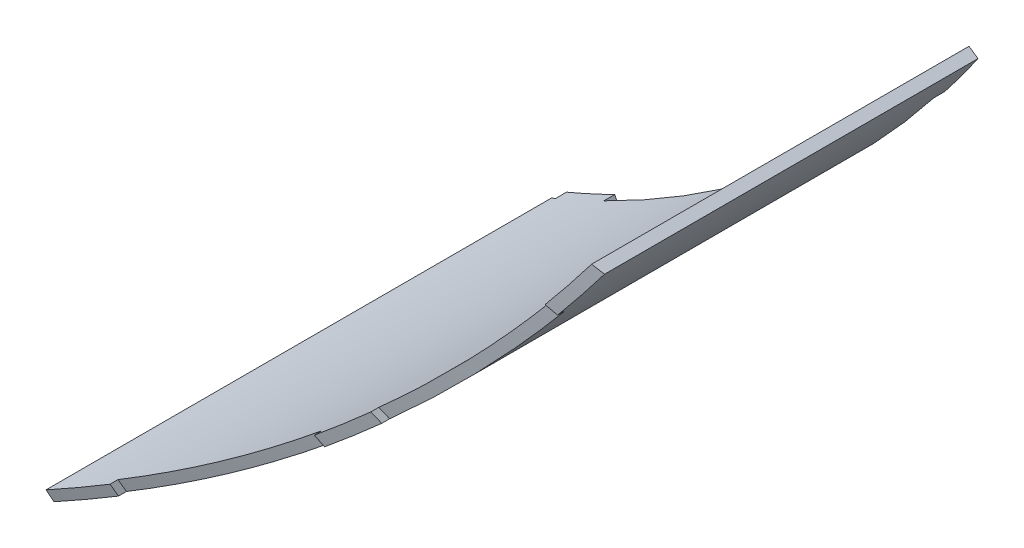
ISO-10303-21;
HEADER;
FILE_DESCRIPTION(('STEP AP214'),'2;1');
FILE_NAME('part.step','',(''),(''),'','','');
FILE_SCHEMA(('AUTOMOTIVE_DESIGN { 1 0 10303 214 1 1 1 1 }'));
ENDSEC;
DATA;
#1=APPLICATION_CONTEXT('core data for automotive mechanical design processes');
#2=APPLICATION_PROTOCOL_DEFINITION('international standard','automotive_design',2000,#1);
#3=PRODUCT_CONTEXT('',#1,'mechanical');
#4=PRODUCT('Part','Part','',(#3));
#5=PRODUCT_RELATED_PRODUCT_CATEGORY('part','',(#4));
#6=PRODUCT_DEFINITION_FORMATION('','',#4);
#7=PRODUCT_DEFINITION_CONTEXT('part definition',#1,'design');
#8=PRODUCT_DEFINITION('design','',#6,#7);
#9=PRODUCT_DEFINITION_SHAPE('','',#8);
#10=(LENGTH_UNIT() NAMED_UNIT(*) SI_UNIT(.MILLI.,.METRE.));
#11=(NAMED_UNIT(*) PLANE_ANGLE_UNIT() SI_UNIT($,.RADIAN.));
#12=(NAMED_UNIT(*) SI_UNIT($,.STERADIAN.) SOLID_ANGLE_UNIT());
#13=UNCERTAINTY_MEASURE_WITH_UNIT(LENGTH_MEASURE(1.E-05),#10,'distance_accuracy_value','');
#14=(GEOMETRIC_REPRESENTATION_CONTEXT(3) GLOBAL_UNCERTAINTY_ASSIGNED_CONTEXT((#13)) GLOBAL_UNIT_ASSIGNED_CONTEXT((#10,
#11,#12)) REPRESENTATION_CONTEXT('',''));
#15=CARTESIAN_POINT('',(0.,0.,0.));
#16=DIRECTION('',(0.,0.,1.));
#17=DIRECTION('',(1.,0.,0.));
#18=AXIS2_PLACEMENT_3D('',#15,#16,#17);
#19=CARTESIAN_POINT('',(485.373501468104,529.087961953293,84.));
#20=CARTESIAN_POINT('',(507.194219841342,404.484163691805,139.));
#21=CARTESIAN_POINT('',(465.296976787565,525.569992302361,84.));
#22=CARTESIAN_POINT('',(495.272994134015,402.39435699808,139.));
#23=CARTESIAN_POINT('',(425.837016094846,514.581425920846,84.));
#24=CARTESIAN_POINT('',(471.842196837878,395.868207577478,139.));
#25=CARTESIAN_POINT('',(370.99883368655,486.868619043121,84.));
#26=CARTESIAN_POINT('',(439.279785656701,379.411729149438,139.));
#27=CARTESIAN_POINT('',(322.618935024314,448.993129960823,84.));
#28=CARTESIAN_POINT('',(410.551719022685,356.921833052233,139.));
#29=CARTESIAN_POINT('',(282.555439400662,402.408554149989,84.));
#30=CARTESIAN_POINT('',(386.76082662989,329.261281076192,139.));
#31=CARTESIAN_POINT('',(252.347269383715,348.904823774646,84.));
#32=CARTESIAN_POINT('',(368.820716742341,297.492490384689,139.));
#33=CARTESIAN_POINT('',(233.15467063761,290.536664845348,84.));
#34=CARTESIAN_POINT('',(357.420161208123,262.835073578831,139.));
#35=CARTESIAN_POINT('',(225.714857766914,229.546183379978,84.));
#36=CARTESIAN_POINT('',(352.996939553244,226.619864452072,139.));
#37=CARTESIAN_POINT('',(230.313579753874,168.27590859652,84.));
#38=CARTESIAN_POINT('',(355.720867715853,190.237337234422,139.));
#39=CARTESIAN_POINT('',(246.774208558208,109.079293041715,84.));
#40=CARTESIAN_POINT('',(365.487369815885,155.084493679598,139.));
#41=CARTESIAN_POINT('',(274.464488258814,54.2300220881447,84.));
#42=CARTESIAN_POINT('',(381.921435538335,122.511049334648,139.));
#43=CARTESIAN_POINT('',(312.320839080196,5.83490506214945,84.));
#44=CARTESIAN_POINT('',(404.392065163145,93.7677451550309,139.));
#45=CARTESIAN_POINT('',(358.889199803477,-34.2472875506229,84.));
#46=CARTESIAN_POINT('',(432.036446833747,69.9581704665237,139.));
#47=CARTESIAN_POINT('',(412.380884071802,-64.4768721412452,84.));
#48=CARTESIAN_POINT('',(463.793160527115,51.9966216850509,139.));
#49=CARTESIAN_POINT('',(470.741282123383,-83.692968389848,84.));
#50=CARTESIAN_POINT('',(498.442820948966,40.5725616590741,139.));
#51=CARTESIAN_POINT('',(531.72877278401,-91.1570958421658,84.));
#52=CARTESIAN_POINT('',(534.655089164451,36.1249603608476,139.));
#53=CARTESIAN_POINT('',(593.000875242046,-86.5830889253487,84.));
#54=CARTESIAN_POINT('',(571.03943964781,38.8242545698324,139.));
#55=CARTESIAN_POINT('',(652.2040616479,-70.1460941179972,84.));
#56=CARTESIAN_POINT('',(606.198863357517,48.5670505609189,139.));
#57=CARTESIAN_POINT('',(707.064458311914,-42.4779880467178,84.));
#58=CARTESIAN_POINT('',(638.783467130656,64.9790316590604,139.));
#59=CARTESIAN_POINT('',(755.474743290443,-4.64098599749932,84.));
#60=CARTESIAN_POINT('',(667.541907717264,87.4303169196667,139.));
#61=CARTESIAN_POINT('',(795.575611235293,41.9112261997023,84.));
#62=CARTESIAN_POINT('',(691.370153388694,115.058577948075,139.));
#63=CARTESIAN_POINT('',(825.826712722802,95.3908040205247,84.));
#64=CARTESIAN_POINT('',(709.353179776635,146.803159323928,139.));
#65=CARTESIAN_POINT('',(845.06614991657,153.743479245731,84.));
#66=CARTESIAN_POINT('',(720.800558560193,181.445102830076,139.));
#67=CARTESIAN_POINT('',(852.554908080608,214.728006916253,84.));
#68=CARTESIAN_POINT('',(725.272715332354,217.654322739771,139.));
#69=CARTESIAN_POINT('',(848.005364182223,276.00192668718,84.));
#70=CARTESIAN_POINT('',(722.597956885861,254.040482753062,139.));
#71=CARTESIAN_POINT('',(831.592244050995,335.211759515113,84.));
#72=CARTESIAN_POINT('',(712.878964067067,289.206506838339,139.));
#73=CARTESIAN_POINT('',(803.946004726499,390.083201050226,84.));
#74=CARTESIAN_POINT('',(696.488938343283,321.802109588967,139.));
#75=CARTESIAN_POINT('',(766.128485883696,438.508742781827,84.));
#76=CARTESIAN_POINT('',(674.05715895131,350.575786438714,139.));
#77=CARTESIAN_POINT('',(719.5923463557,478.6281946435,84.));
#78=CARTESIAN_POINT('',(646.445000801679,374.422637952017,139.));
#79=CARTESIAN_POINT('',(666.124872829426,508.900882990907,84.));
#80=CARTESIAN_POINT('',(614.712545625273,392.42719251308,139.));
#81=CARTESIAN_POINT('',(607.78003912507,528.16348011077,84.));
#82=CARTESIAN_POINT('',(580.078440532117,403.897850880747,139.));
#83=CARTESIAN_POINT('',(546.798319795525,535.67718908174,84.));
#84=CARTESIAN_POINT('',(543.872039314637,408.394829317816,139.));
#85=CARTESIAN_POINT('',(505.948212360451,532.659605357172,84.));
#86=CARTESIAN_POINT('',(519.613656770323,406.627411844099,139.));
#87=CARTESIAN_POINT('',(485.866066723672,529.173865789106,84.));
#88=CARTESIAN_POINT('',(507.686826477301,404.569832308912,139.));
#89=B_SPLINE_SURFACE_WITH_KNOTS('',3,1,((#19,#20),(#21,#22),(#23,#24),(#25,#26),(#27,#28),(#29,
#30),(#31,#32),(#33,#34),(#35,#36),(#37,#38),(#39,#40),(#41,#42),(#43,#44),(#45,#46),(#47,#48),
(#49,#50),(#51,#52),(#53,#54),(#55,#56),(#57,#58),(#59,#60),(#61,#62),(#63,#64),(#65,#66),(#67,
#68),(#69,#70),(#71,#72),(#73,#74),(#75,#76),(#77,#78),(#79,#80),(#81,#82),(#83,#84),(#85,#86),
(#87,#88)),.UNSPECIFIED.,.F.,.F.,.F.,(4,1,1,1,1,1,1,1,1,1,1,1,1,1,1,1,1,1,1,1,1,1,1,1,1,1,1,1,1,
1,1,1,4),(2,2),(0.,0.03125,0.0625,0.09375,0.125,0.15625,0.1875,0.21875,0.25,0.28125,0.3125,
0.34375,0.375,0.40625,0.4375,0.46875,0.5,0.53125,0.5625,0.59375,0.625,0.65625,0.6875,0.71875,
0.75,0.78125,0.8125,0.84375,0.875,0.90625,0.9375,0.96875,1.),(0.,1.),.UNSPECIFIED.);
#90=CARTESIAN_POINT('',(706.145386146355,127.131608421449,135.868700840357));
#91=CARTESIAN_POINT('',(707.899742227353,127.863041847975,135.363318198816));
#92=CARTESIAN_POINT('',(709.6458746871,128.613758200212,134.857535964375));
#93=CARTESIAN_POINT('',(713.121019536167,130.153451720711,133.845395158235));
#94=CARTESIAN_POINT('',(714.850031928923,130.942428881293,133.339036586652));
#95=CARTESIAN_POINT('',(720.01085697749,133.366518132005,131.819290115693));
#96=CARTESIAN_POINT('',(723.415971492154,135.058585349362,130.805371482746));
#97=CARTESIAN_POINT('',(730.148665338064,138.591455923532,128.777836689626));
#98=CARTESIAN_POINT('',(733.476234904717,140.432277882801,127.764220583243));
#99=CARTESIAN_POINT('',(740.04766207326,144.259343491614,125.739121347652));
#100=CARTESIAN_POINT('',(743.291514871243,146.245595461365,124.727638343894));
#101=CARTESIAN_POINT('',(749.616272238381,150.312917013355,122.731580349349));
#102=CARTESIAN_POINT('',(752.699205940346,152.39078977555,121.746917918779));
#103=CARTESIAN_POINT('',(758.773351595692,156.678142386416,119.782710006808));
#104=CARTESIAN_POINT('',(761.76457303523,158.887608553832,118.803164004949));
#105=CARTESIAN_POINT('',(767.64964571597,163.434141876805,116.850434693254));
#106=CARTESIAN_POINT('',(770.543513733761,165.771186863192,115.877250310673));
#107=CARTESIAN_POINT('',(776.228489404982,170.568715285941,113.938259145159));
#108=CARTESIAN_POINT('',(779.019621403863,173.029169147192,112.972450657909));
#109=CARTESIAN_POINT('',(783.502257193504,177.156120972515,111.39775849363));
#110=CARTESIAN_POINT('',(785.225663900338,178.787173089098,110.786380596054));
#111=CARTESIAN_POINT('',(788.627369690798,182.096580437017,109.567367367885));
#112=CARTESIAN_POINT('',(790.305674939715,183.774929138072,108.959731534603));
#113=CARTESIAN_POINT('',(793.615947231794,187.177782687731,107.748450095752));
#114=CARTESIAN_POINT('',(795.24791857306,188.902283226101,107.144804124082));
#115=CARTESIAN_POINT('',(798.464356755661,192.396305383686,105.941717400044));
#116=CARTESIAN_POINT('',(800.048825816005,194.165824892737,105.342276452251));
#117=CARTESIAN_POINT('',(803.19230431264,197.775358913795,104.138918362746));
#118=CARTESIAN_POINT('',(804.750584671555,199.616030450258,103.535067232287));
#119=CARTESIAN_POINT('',(807.81583732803,203.341290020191,102.332095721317));
#120=CARTESIAN_POINT('',(809.322806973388,205.225880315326,101.732975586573));
#121=CARTESIAN_POINT('',(812.28427564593,209.037710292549,100.539640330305));
#122=CARTESIAN_POINT('',(813.738769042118,210.964954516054,99.945425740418));
#123=CARTESIAN_POINT('',(816.594155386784,214.860791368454,98.7620595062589));
#124=CARTESIAN_POINT('',(817.995039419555,216.829390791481,98.1729087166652));
#125=CARTESIAN_POINT('',(819.368397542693,218.817795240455,97.5864347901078));
#126=B_SPLINE_CURVE_WITH_KNOTS('',3,(#90,#91,#92,#93,#94,#95,#96,#97,#98,#99,#100,#101,#102,
#103,#104,#105,#106,#107,#108,#109,#110,#111,#112,#113,#114,#115,#116,#117,#118,#119,#120,#121,
#122,#123,#124,#125),.UNSPECIFIED.,.F.,.F.,(4,2,2,2,2,2,2,2,2,2,2,2,2,2,2,2,2,4),(0.,
5.90006578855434,11.8001303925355,23.6018928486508,35.4051334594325,47.2090498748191,
58.7436813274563,70.2771156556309,81.8085521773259,93.3372382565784,100.687522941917,
108.036797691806,115.385388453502,122.733635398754,130.19116493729,137.649079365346,
145.107791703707,152.567739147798),.UNSPECIFIED.);
#127=CARTESIAN_POINT('',(719.906011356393,133.346491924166,131.846627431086));
#128=VERTEX_POINT('',#127);
#129=CARTESIAN_POINT('',(763.114468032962,159.940318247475,118.353997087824));
#130=VERTEX_POINT('',#129);
#131=EDGE_CURVE('E57',#128,#130,#126,.T.);
#132=CARTESIAN_POINT('',(763.114468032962,159.940318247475,118.353997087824));
#133=CARTESIAN_POINT('',(762.811965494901,160.338227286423,118.527094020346));
#134=CARTESIAN_POINT('',(762.509414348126,160.736200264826,118.699958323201));
#135=CARTESIAN_POINT('',(761.904214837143,161.532274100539,119.045221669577));
#136=CARTESIAN_POINT('',(761.601566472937,161.93037495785,119.217620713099));
#137=CARTESIAN_POINT('',(761.298869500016,162.328539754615,119.389787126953));
#138=B_SPLINE_CURVE_WITH_KNOTS('',3,(#132,#133,#134,#135,#136,#137),.UNSPECIFIED.,.F.,.F.,(4,2,
4),(0.,1.58688871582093,3.17377743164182),.UNSPECIFIED.);
#139=CARTESIAN_POINT('',(761.298869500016,162.328539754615,119.389787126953));
#140=VERTEX_POINT('',#139);
#141=EDGE_CURVE('E222',#130,#140,#138,.T.);
#142=CARTESIAN_POINT('',(816.899952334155,220.522722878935,98.6664789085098));
#143=CARTESIAN_POINT('',(815.19563541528,218.055124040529,99.4008149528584));
#144=CARTESIAN_POINT('',(813.44843377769,215.618417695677,100.139393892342));
#145=CARTESIAN_POINT('',(809.870501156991,210.809387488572,101.624710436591));
#146=CARTESIAN_POINT('',(808.039764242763,208.43706821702,102.371448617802));
#147=CARTESIAN_POINT('',(804.297129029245,203.759617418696,103.872698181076));
#148=CARTESIAN_POINT('',(802.38522574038,201.454490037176,104.627210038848));
#149=CARTESIAN_POINT('',(798.482738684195,196.91411918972,106.143581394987));
#150=CARTESIAN_POINT('',(796.492151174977,194.678879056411,106.905441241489));
#151=CARTESIAN_POINT('',(792.434854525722,190.280894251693,108.436038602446));
#152=CARTESIAN_POINT('',(790.368143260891,188.118151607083,109.204776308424));
#153=CARTESIAN_POINT('',(786.208678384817,183.915605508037,110.731202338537));
#154=CARTESIAN_POINT('',(784.117562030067,181.874129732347,111.488749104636));
#155=CARTESIAN_POINT('',(779.867732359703,177.865169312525,113.009366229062));
#156=CARTESIAN_POINT('',(777.709022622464,175.897680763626,113.772436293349));
#157=CARTESIAN_POINT('',(773.326644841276,172.038883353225,115.303496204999));
#158=CARTESIAN_POINT('',(771.102983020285,170.147567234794,116.071485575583));
#159=CARTESIAN_POINT('',(766.593409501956,166.443210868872,117.611791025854));
#160=CARTESIAN_POINT('',(764.307506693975,164.630159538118,118.384106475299));
#161=CARTESIAN_POINT('',(759.67626544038,161.084360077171,119.932533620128));
#162=CARTESIAN_POINT('',(757.330938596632,159.351596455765,120.708644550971));
#163=CARTESIAN_POINT('',(752.383156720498,155.82535506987,122.32976341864));
#164=CARTESIAN_POINT('',(749.775680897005,154.039052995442,123.17506929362));
#165=CARTESIAN_POINT('',(744.497435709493,150.565140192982,124.868717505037));
#166=CARTESIAN_POINT('',(741.82667687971,148.877513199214,125.717059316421));
#167=CARTESIAN_POINT('',(736.425169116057,145.602876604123,127.415960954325));
#168=CARTESIAN_POINT('',(733.694424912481,144.015859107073,128.266520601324));
#169=CARTESIAN_POINT('',(728.13486602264,140.921237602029,129.981663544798));
#170=CARTESIAN_POINT('',(725.30519454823,139.415183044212,130.846265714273));
#171=CARTESIAN_POINT('',(719.590993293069,136.510496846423,132.575738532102));
#172=CARTESIAN_POINT('',(716.706458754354,135.111874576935,133.440609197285));
#173=CARTESIAN_POINT('',(710.886096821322,132.423804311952,135.169606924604));
#174=CARTESIAN_POINT('',(707.95026069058,131.13437513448,136.033733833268));
#175=CARTESIAN_POINT('',(704.990933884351,129.900586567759,136.89687144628));
#176=B_SPLINE_CURVE_WITH_KNOTS('',3,(#142,#143,#144,#145,#146,#147,#148,#149,#150,#151,#152,
#153,#154,#155,#156,#157,#158,#159,#160,#161,#162,#163,#164,#165,#166,#167,#168,#169,#170,#171,
#172,#173,#174,#175),.UNSPECIFIED.,.F.,.F.,(4,2,2,2,2,2,2,2,2,2,2,2,2,2,2,2,4),(0.,
9.26219558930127,18.5250498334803,27.7884743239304,37.0523398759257,46.3164642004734,
55.3717544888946,64.4265662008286,73.4805132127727,82.5331738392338,91.5840804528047,
101.397196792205,111.208690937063,121.01941413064,130.977388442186,140.936230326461,
150.896785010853),.UNSPECIFIED.);
#177=CARTESIAN_POINT('',(718.591862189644,136.04334415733,132.873213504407));
#178=VERTEX_POINT('',#177);
#179=EDGE_CURVE('E443',#140,#178,#176,.T.);
#180=CARTESIAN_POINT('',(718.591862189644,136.04334415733,132.873213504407));
#181=CARTESIAN_POINT('',(718.810970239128,135.593698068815,132.702670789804));
#182=CARTESIAN_POINT('',(719.030036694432,135.14413733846,132.531850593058));
#183=CARTESIAN_POINT('',(719.468086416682,134.245186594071,132.189655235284));
#184=CARTESIAN_POINT('',(719.687069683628,133.795796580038,132.018280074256));
#185=CARTESIAN_POINT('',(719.906011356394,133.346491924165,131.846627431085));
#186=B_SPLINE_CURVE_WITH_KNOTS('',3,(#180,#181,#182,#183,#184,#185),.UNSPECIFIED.,.F.,.F.,(4,2,
4),(0.,1.58539285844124,3.17078571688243),.UNSPECIFIED.);
#187=EDGE_CURVE('E11',#178,#128,#186,.T.);
#188=ORIENTED_EDGE('',*,*,#131,.T.);
#189=ORIENTED_EDGE('',*,*,#141,.T.);
#190=ORIENTED_EDGE('',*,*,#179,.T.);
#191=ORIENTED_EDGE('',*,*,#187,.T.);
#192=EDGE_LOOP('',(#188,#189,#190,#191));
#193=FACE_BOUND('',#192,.T.);
#194=ADVANCED_FACE('F43',(#193),#89,.T.);
#195=CARTESIAN_POINT('',(807.869924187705,208.248349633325,102.436107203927));
#196=VERTEX_POINT('',#195);
#197=CARTESIAN_POINT('',(772.927232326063,171.717891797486,115.43895959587));
#198=VERTEX_POINT('',#197);
#199=EDGE_CURVE('E303',#196,#198,#176,.T.);
#200=CARTESIAN_POINT('',(772.927232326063,171.717891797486,115.438959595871));
#201=CARTESIAN_POINT('',(773.252687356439,171.338113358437,115.265760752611));
#202=CARTESIAN_POINT('',(773.578092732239,170.958392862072,115.092342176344));
#203=CARTESIAN_POINT('',(774.228804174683,170.199067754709,114.745065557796));
#204=CARTESIAN_POINT('',(774.554110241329,169.819463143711,114.571207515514));
#205=CARTESIAN_POINT('',(774.879366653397,169.439916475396,114.397129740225));
#206=B_SPLINE_CURVE_WITH_KNOTS('',3,(#200,#201,#202,#203,#204,#205),.UNSPECIFIED.,.F.,.F.,(4,2,
4),(0.,1.58787683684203,3.17575367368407),.UNSPECIFIED.);
#207=CARTESIAN_POINT('',(774.879366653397,169.439916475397,114.397129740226));
#208=VERTEX_POINT('',#207);
#209=EDGE_CURVE('E220',#198,#208,#206,.T.);
#210=CARTESIAN_POINT('',(810.232342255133,206.399300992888,101.366074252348));
#211=VERTEX_POINT('',#210);
#212=EDGE_CURVE('E204',#208,#211,#126,.T.);
#213=CARTESIAN_POINT('',(810.232342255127,206.39930099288,101.366074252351));
#214=CARTESIAN_POINT('',(809.838704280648,206.707398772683,101.544763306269));
#215=CARTESIAN_POINT('',(809.445017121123,207.015535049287,101.723277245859));
#216=CARTESIAN_POINT('',(808.657544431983,207.631884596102,102.079954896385));
#217=CARTESIAN_POINT('',(808.263758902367,207.940097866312,102.25811860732));
#218=CARTESIAN_POINT('',(807.869924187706,208.248349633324,102.436107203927));
#219=B_SPLINE_CURVE_WITH_KNOTS('',3,(#213,#214,#215,#216,#217,#218),.UNSPECIFIED.,.F.,.F.,(4,2,
4),(0.,1.59255861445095,3.18511722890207),.UNSPECIFIED.);
#220=EDGE_CURVE('E72',#211,#196,#219,.T.);
#221=ORIENTED_EDGE('',*,*,#199,.T.);
#222=ORIENTED_EDGE('',*,*,#209,.T.);
#223=ORIENTED_EDGE('',*,*,#212,.T.);
#224=ORIENTED_EDGE('',*,*,#220,.T.);
#225=EDGE_LOOP('',(#221,#222,#223,#224));
#226=FACE_BOUND('',#225,.T.);
#227=ADVANCED_FACE('F291',(#226),#89,.T.);
#228=CARTESIAN_POINT('',(606.669538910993,365.726530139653,0.));
#229=DIRECTION('',(0.,0.,1.));
#230=DIRECTION('',(1.,0.,0.));
#231=AXIS2_PLACEMENT_3D('',#228,#229,#230);
#232=PLANE('',#231);
#233=DIRECTION('',(0.607276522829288,-0.794490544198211,0.));
#234=VECTOR('',#233,1.);
#235=CARTESIAN_POINT('',(714.195946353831,225.05138339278,0.));
#236=LINE('',#235,#234);
#237=CARTESIAN_POINT('',(761.829548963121,162.733072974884,0.));
#238=VERTEX_POINT('',#237);
#239=CARTESIAN_POINT('',(763.651378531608,160.34960134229,0.));
#240=VERTEX_POINT('',#239);
#241=EDGE_CURVE('E387',#238,#240,#236,.T.);
#242=ORIENTED_EDGE('',*,*,#241,.T.);
#243=CARTESIAN_POINT('',(606.669538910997,365.726530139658,0.));
#244=DIRECTION('',(0.,0.,1.));
#245=DIRECTION('',(1.,0.,0.));
#246=AXIS2_PLACEMENT_3D('',#243,#244,#245);
#247=CIRCLE('',#246,258.501413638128);
#248=CARTESIAN_POINT('',(720.736904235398,133.753219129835,0.));
#249=VERTEX_POINT('',#248);
#250=EDGE_CURVE('E363',#249,#240,#247,.T.);
#251=ORIENTED_EDGE('',*,*,#250,.F.);
#252=DIRECTION('',(0.441263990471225,-0.897377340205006,0.));
#253=VECTOR('',#252,1.);
#254=CARTESIAN_POINT('',(690.54565493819,195.15170977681,0.));
#255=LINE('',#254,#253);
#256=CARTESIAN_POINT('',(719.413112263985,136.445351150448,0.));
#257=VERTEX_POINT('',#256);
#258=EDGE_CURVE('E357',#257,#249,#255,.T.);
#259=ORIENTED_EDGE('',*,*,#258,.F.);
#260=CARTESIAN_POINT('',(606.669538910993,365.726530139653,0.));
#261=DIRECTION('',(0.,0.,-1.));
#262=DIRECTION('',(1.,0.,0.));
#263=AXIS2_PLACEMENT_3D('',#260,#261,#262);
#264=CIRCLE('',#263,255.501413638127);
#265=EDGE_CURVE('E338',#238,#257,#264,.T.);
#266=ORIENTED_EDGE('',*,*,#265,.F.);
#267=EDGE_LOOP('',(#242,#251,#259,#266));
#268=FACE_BOUND('',#267,.T.);
#269=ADVANCED_FACE('F297',(#268),#232,.F.);
#270=DIRECTION('',(0.629320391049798,-0.777145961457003,0.));
#271=VECTOR('',#270,1.);
#272=CARTESIAN_POINT('',(722.783670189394,235.049645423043,0.));
#273=LINE('',#272,#271);
#274=CARTESIAN_POINT('',(773.600118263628,172.296558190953,0.));
#275=VERTEX_POINT('',#274);
#276=CARTESIAN_POINT('',(775.488994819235,169.963989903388,0.));
#277=VERTEX_POINT('',#276);
#278=EDGE_CURVE('E389',#275,#277,#273,.T.);
#279=ORIENTED_EDGE('',*,*,#278,.F.);
#280=CARTESIAN_POINT('',(807.869924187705,208.248349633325,0.));
#281=VERTEX_POINT('',#280);
#282=EDGE_CURVE('E350',#281,#275,#264,.T.);
#283=ORIENTED_EDGE('',*,*,#282,.F.);
#284=DIRECTION('',(0.787472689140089,-0.61634954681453,0.));
#285=VECTOR('',#284,1.);
#286=CARTESIAN_POINT('',(724.931151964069,273.163965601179,0.));
#287=LINE('',#286,#285);
#288=CARTESIAN_POINT('',(810.232342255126,206.39930099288,0.));
#289=VERTEX_POINT('',#288);
#290=EDGE_CURVE('E386',#281,#289,#287,.T.);
#291=ORIENTED_EDGE('',*,*,#290,.T.);
#292=EDGE_CURVE('E431',#277,#289,#247,.T.);
#293=ORIENTED_EDGE('',*,*,#292,.F.);
#294=EDGE_LOOP('',(#279,#283,#291,#293));
#295=FACE_BOUND('',#294,.T.);
#296=ADVANCED_FACE('F328',(#295),#232,.F.);
#297=CARTESIAN_POINT('',(606.669538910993,365.726530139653,139.001));
#298=DIRECTION('',(0.,0.,-1.));
#299=DIRECTION('',(-1.,0.,0.));
#300=AXIS2_PLACEMENT_3D('',#297,#298,#299);
#301=CYLINDRICAL_SURFACE('',#300,255.501413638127);
#302=ORIENTED_EDGE('',*,*,#265,.T.);
#303=DIRECTION('',(0.,0.,1.));
#304=VECTOR('',#303,1.);
#305=CARTESIAN_POINT('',(719.413112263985,136.445351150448,-21.2122468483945));
#306=LINE('',#305,#304);
#307=CARTESIAN_POINT('',(719.413112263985,136.445351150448,-3.));
#308=VERTEX_POINT('',#307);
#309=EDGE_CURVE('E341',#308,#257,#306,.T.);
#310=ORIENTED_EDGE('',*,*,#309,.F.);
#311=CARTESIAN_POINT('',(606.669538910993,365.726530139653,-3.));
#312=DIRECTION('',(0.,0.,1.));
#313=DIRECTION('',(1.,0.,0.));
#314=AXIS2_PLACEMENT_3D('',#311,#312,#313);
#315=CIRCLE('',#314,255.501413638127);
#316=CARTESIAN_POINT('',(706.145386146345,130.385228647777,-3.));
#317=VERTEX_POINT('',#316);
#318=EDGE_CURVE('E571',#308,#317,#315,.F.);
#319=ORIENTED_EDGE('',*,*,#318,.T.);
#320=DIRECTION('',(0.,0.,1.));
#321=VECTOR('',#320,1.);
#322=CARTESIAN_POINT('',(706.145386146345,130.385228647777,-21.2122468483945));
#323=LINE('',#322,#321);
#324=CARTESIAN_POINT('',(706.145386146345,130.385228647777,0.));
#325=VERTEX_POINT('',#324);
#326=EDGE_CURVE('E360',#317,#325,#323,.T.);
#327=ORIENTED_EDGE('',*,*,#326,.T.);
#328=CARTESIAN_POINT('',(704.990933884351,129.900586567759,0.));
#329=VERTEX_POINT('',#328);
#330=EDGE_CURVE('E351',#325,#329,#264,.T.);
#331=ORIENTED_EDGE('',*,*,#330,.T.);
#332=DIRECTION('',(0.,0.,-1.));
#333=VECTOR('',#332,1.);
#334=CARTESIAN_POINT('',(704.990933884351,129.900586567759,139.001));
#335=LINE('',#334,#333);
#336=CARTESIAN_POINT('',(704.990933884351,129.900586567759,139.077730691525));
#337=VERTEX_POINT('',#336);
#338=EDGE_CURVE('E451',#337,#329,#335,.T.);
#339=ORIENTED_EDGE('',*,*,#338,.F.);
#340=CARTESIAN_POINT('',(718.591862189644,136.04334415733,135.054071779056));
#341=CARTESIAN_POINT('',(716.355117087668,134.953411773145,135.725374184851));
#342=CARTESIAN_POINT('',(714.103333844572,133.896549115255,136.396330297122));
#343=CARTESIAN_POINT('',(709.569691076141,131.848963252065,137.737549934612));
#344=CARTESIAN_POINT('',(707.287831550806,130.858240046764,138.407813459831));
#345=CARTESIAN_POINT('',(704.990933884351,129.900586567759,139.077730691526));
#346=B_SPLINE_CURVE_WITH_KNOTS('',3,(#340,#341,#342,#343,#344,#345),.UNSPECIFIED.,.F.,.F.,(4,2,
4),(0.,7.72910195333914,15.4582039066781),.UNSPECIFIED.);
#347=CARTESIAN_POINT('',(718.591862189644,136.04334415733,135.054071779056));
#348=VERTEX_POINT('',#347);
#349=EDGE_CURVE('E464',#348,#337,#346,.T.);
#350=ORIENTED_EDGE('',*,*,#349,.F.);
#351=DIRECTION('',(0.,0.,-1.));
#352=VECTOR('',#351,1.);
#353=CARTESIAN_POINT('',(718.591862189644,136.04334415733,144.402484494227));
#354=LINE('',#353,#352);
#355=EDGE_CURVE('E563',#348,#178,#354,.T.);
#356=ORIENTED_EDGE('',*,*,#355,.T.);
#357=ORIENTED_EDGE('',*,*,#179,.F.);
#358=DIRECTION('',(0.,0.,-1.));
#359=VECTOR('',#358,1.);
#360=CARTESIAN_POINT('',(761.298869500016,162.328539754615,144.402484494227));
#361=LINE('',#360,#359);
#362=CARTESIAN_POINT('',(761.298869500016,162.328539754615,121.570645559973));
#363=VERTEX_POINT('',#362);
#364=EDGE_CURVE('E256',#363,#140,#361,.T.);
#365=ORIENTED_EDGE('',*,*,#364,.F.);
#366=CARTESIAN_POINT('',(772.927232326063,171.717891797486,117.619817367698));
#367=CARTESIAN_POINT('',(772.548682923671,171.393489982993,117.750885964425));
#368=CARTESIAN_POINT('',(772.169197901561,171.070208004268,117.882023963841));
#369=CARTESIAN_POINT('',(771.408418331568,170.425935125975,118.144419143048));
#370=CARTESIAN_POINT('',(771.027124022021,170.104943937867,118.275676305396));
#371=CARTESIAN_POINT('',(770.262727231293,169.465251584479,118.538311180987));
#372=CARTESIAN_POINT('',(769.879624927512,169.146550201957,118.669688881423));
#373=CARTESIAN_POINT('',(769.111613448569,168.511436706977,118.932566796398));
#374=CARTESIAN_POINT('',(768.726704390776,168.195024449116,119.064067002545));
#375=CARTESIAN_POINT('',(767.955080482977,167.564488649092,119.32719173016));
#376=CARTESIAN_POINT('',(767.568365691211,167.250365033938,119.458816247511));
#377=CARTESIAN_POINT('',(766.793131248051,166.624406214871,119.722191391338));
#378=CARTESIAN_POINT('',(766.404611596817,166.312571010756,119.853942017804));
#379=CARTESIAN_POINT('',(765.625768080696,165.691188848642,120.117571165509));
#380=CARTESIAN_POINT('',(765.235444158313,165.381641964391,120.249449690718));
#381=CARTESIAN_POINT('',(764.45299260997,164.764836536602,120.513336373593));
#382=CARTESIAN_POINT('',(764.060864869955,164.457578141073,120.645344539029));
#383=CARTESIAN_POINT('',(763.274806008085,163.845350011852,120.909492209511));
#384=CARTESIAN_POINT('',(762.880874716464,163.54038050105,121.041631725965));
#385=CARTESIAN_POINT('',(762.091208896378,162.932730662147,121.306043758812));
#386=CARTESIAN_POINT('',(761.695474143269,162.630050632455,121.438316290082));
#387=CARTESIAN_POINT('',(761.298869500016,162.328539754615,121.570645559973));
#388=B_SPLINE_CURVE_WITH_KNOTS('',3,(#366,#367,#368,#369,#370,#371,#372,#373,#374,#375,#376,
#377,#378,#379,#380,#381,#382,#383,#384,#385,#386,#387),.UNSPECIFIED.,.F.,.F.,(4,2,2,2,2,2,2,2,
2,2,4),(0.,1.54642492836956,3.09265150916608,4.63872940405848,6.18470821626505,7.73063750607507,
9.27656665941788,10.8225454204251,12.3686233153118,13.9148498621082,15.4612745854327),.UNSPECIFIED.);
#389=CARTESIAN_POINT('',(772.927232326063,171.717891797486,117.619817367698));
#390=VERTEX_POINT('',#389);
#391=EDGE_CURVE('E215',#390,#363,#388,.T.);
#392=ORIENTED_EDGE('',*,*,#391,.F.);
#393=DIRECTION('',(0.,0.,-1.));
#394=VECTOR('',#393,1.);
#395=CARTESIAN_POINT('',(772.927232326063,171.717891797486,144.402484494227));
#396=LINE('',#395,#394);
#397=EDGE_CURVE('E211',#390,#198,#396,.T.);
#398=ORIENTED_EDGE('',*,*,#397,.T.);
#399=ORIENTED_EDGE('',*,*,#199,.F.);
#400=DIRECTION('',(0.,0.,-1.));
#401=VECTOR('',#400,1.);
#402=CARTESIAN_POINT('',(807.869924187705,208.248349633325,144.402484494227));
#403=LINE('',#402,#401);
#404=CARTESIAN_POINT('',(807.869924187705,208.248349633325,104.616965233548));
#405=VERTEX_POINT('',#404);
#406=EDGE_CURVE('E272',#405,#196,#403,.T.);
#407=ORIENTED_EDGE('',*,*,#406,.F.);
#408=CARTESIAN_POINT('',(816.899952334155,220.522722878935,100.847336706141));
#409=CARTESIAN_POINT('',(816.611017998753,220.104395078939,100.971826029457));
#410=CARTESIAN_POINT('',(816.320852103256,219.68695444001,101.096438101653));
#411=CARTESIAN_POINT('',(815.73810756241,218.85391757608,101.345888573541));
#412=CARTESIAN_POINT('',(815.445529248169,218.43832110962,101.470726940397));
#413=CARTESIAN_POINT('',(814.857961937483,217.60897166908,101.720631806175));
#414=CARTESIAN_POINT('',(814.562973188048,217.195218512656,101.845698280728));
#415=CARTESIAN_POINT('',(813.970586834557,216.369554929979,102.09606114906));
#416=CARTESIAN_POINT('',(813.673189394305,215.957644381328,102.221357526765));
#417=CARTESIAN_POINT('',(813.075987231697,215.135665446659,102.472182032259));
#418=CARTESIAN_POINT('',(812.776182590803,214.725596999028,102.597710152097));
#419=CARTESIAN_POINT('',(812.1741674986,213.907302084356,102.849000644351));
#420=CARTESIAN_POINT('',(811.871957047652,213.499075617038,102.974763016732));
#421=CARTESIAN_POINT('',(811.265131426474,212.684464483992,103.226524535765));
#422=CARTESIAN_POINT('',(810.960516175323,212.278079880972,103.352523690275));
#423=CARTESIAN_POINT('',(810.34888186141,211.467152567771,103.604761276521));
#424=CARTESIAN_POINT('',(810.041862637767,211.062609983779,103.730999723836));
#425=CARTESIAN_POINT('',(809.425421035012,210.255366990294,103.98371839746));
#426=CARTESIAN_POINT('',(809.115998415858,209.85266677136,104.110198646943));
#427=CARTESIAN_POINT('',(808.494750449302,209.049108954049,104.363403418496));
#428=CARTESIAN_POINT('',(808.182924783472,208.648251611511,104.490127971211));
#429=CARTESIAN_POINT('',(807.869924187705,208.248349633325,104.616965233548));
#430=B_SPLINE_CURVE_WITH_KNOTS('',3,(#408,#409,#410,#411,#412,#413,#414,#415,#416,#417,#418,
#419,#420,#421,#422,#423,#424,#425,#426,#427,#428,#429),.UNSPECIFIED.,.F.,.F.,(4,2,2,2,2,2,2,2,
2,2,4),(0.,1.57028727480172,3.14036249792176,4.71027879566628,6.28008921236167,7.84984672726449,
9.41960400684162,10.9894143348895,12.5593306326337,14.1294057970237,15.6996927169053),.UNSPECIFIED.);
#431=CARTESIAN_POINT('',(816.899952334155,220.522722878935,100.847336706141));
#432=VERTEX_POINT('',#431);
#433=EDGE_CURVE('E539',#432,#405,#430,.T.);
#434=ORIENTED_EDGE('',*,*,#433,.F.);
#435=DIRECTION('',(0.,0.,-1.));
#436=VECTOR('',#435,1.);
#437=CARTESIAN_POINT('',(816.899952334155,220.522722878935,139.001));
#438=LINE('',#437,#436);
#439=CARTESIAN_POINT('',(816.899952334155,220.522722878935,-3.));
#440=VERTEX_POINT('',#439);
#441=EDGE_CURVE('E412',#432,#440,#438,.T.);
#442=ORIENTED_EDGE('',*,*,#441,.T.);
#443=CARTESIAN_POINT('',(606.669538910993,365.726530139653,-3.));
#444=DIRECTION('',(0.,0.,1.));
#445=DIRECTION('',(1.,0.,0.));
#446=AXIS2_PLACEMENT_3D('',#443,#444,#445);
#447=CIRCLE('',#446,255.501413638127);
#448=CARTESIAN_POINT('',(807.869924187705,208.248349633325,-3.));
#449=VERTEX_POINT('',#448);
#450=EDGE_CURVE('E406',#440,#449,#447,.F.);
#451=ORIENTED_EDGE('',*,*,#450,.T.);
#452=DIRECTION('',(0.,0.,1.));
#453=VECTOR('',#452,1.);
#454=CARTESIAN_POINT('',(807.869924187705,208.248349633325,-21.2122468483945));
#455=LINE('',#454,#453);
#456=EDGE_CURVE('E425',#449,#281,#455,.T.);
#457=ORIENTED_EDGE('',*,*,#456,.T.);
#458=ORIENTED_EDGE('',*,*,#282,.T.);
#459=DIRECTION('',(0.,0.,1.));
#460=VECTOR('',#459,1.);
#461=CARTESIAN_POINT('',(773.600118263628,172.296558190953,-21.2122468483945));
#462=LINE('',#461,#460);
#463=CARTESIAN_POINT('',(773.600118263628,172.296558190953,-3.));
#464=VERTEX_POINT('',#463);
#465=EDGE_CURVE('E398',#464,#275,#462,.T.);
#466=ORIENTED_EDGE('',*,*,#465,.F.);
#467=CARTESIAN_POINT('',(606.669538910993,365.726530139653,-3.));
#468=DIRECTION('',(0.,0.,1.));
#469=DIRECTION('',(1.,0.,0.));
#470=AXIS2_PLACEMENT_3D('',#467,#468,#469);
#471=CIRCLE('',#470,255.501413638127);
#472=CARTESIAN_POINT('',(761.829548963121,162.733072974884,-3.));
#473=VERTEX_POINT('',#472);
#474=EDGE_CURVE('E381',#464,#473,#471,.F.);
#475=ORIENTED_EDGE('',*,*,#474,.T.);
#476=DIRECTION('',(0.,0.,1.));
#477=VECTOR('',#476,1.);
#478=CARTESIAN_POINT('',(761.829548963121,162.733072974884,-21.2122468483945));
#479=LINE('',#478,#477);
#480=EDGE_CURVE('E345',#473,#238,#479,.T.);
#481=ORIENTED_EDGE('',*,*,#480,.T.);
#482=EDGE_LOOP('',(#302,#310,#319,#327,#331,#339,#350,#356,#357,#365,#392,#398,#399,#407,#434,
#442,#451,#457,#458,#466,#475,#481));
#483=FACE_BOUND('',#482,.T.);
#484=ADVANCED_FACE('F324',(#483),#301,.F.);
#485=CARTESIAN_POINT('',(706.145386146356,127.131608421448,139.001));
#486=DIRECTION('',(0.922992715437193,0.384817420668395,0.));
#487=DIRECTION('',(-0.384817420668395,0.922992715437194,0.));
#488=AXIS2_PLACEMENT_3D('',#485,#486,#487);
#489=PLANE('',#488);
#490=DIRECTION('',(0.,0.,-1.));
#491=VECTOR('',#490,1.);
#492=CARTESIAN_POINT('',(706.145386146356,127.131608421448,139.001));
#493=LINE('',#492,#491);
#494=CARTESIAN_POINT('',(706.145386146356,127.131608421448,138.049560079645));
#495=VERTEX_POINT('',#494);
#496=CARTESIAN_POINT('',(706.145386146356,127.131608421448,0.));
#497=VERTEX_POINT('',#496);
#498=EDGE_CURVE('E433',#495,#497,#493,.T.);
#499=ORIENTED_EDGE('',*,*,#498,.F.);
#500=CARTESIAN_POINT('',(704.990933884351,129.900586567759,139.077730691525));
#501=CARTESIAN_POINT('',(705.183418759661,129.438907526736,138.90694642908));
#502=CARTESIAN_POINT('',(705.375865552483,128.977319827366,138.735873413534));
#503=CARTESIAN_POINT('',(705.760682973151,128.054327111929,138.393149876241));
#504=CARTESIAN_POINT('',(705.953053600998,127.592922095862,138.221499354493));
#505=CARTESIAN_POINT('',(706.145386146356,127.131608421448,138.049560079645));
#506=B_SPLINE_CURVE_WITH_KNOTS('',3,(#500,#501,#502,#503,#504,#505),.UNSPECIFIED.,.F.,.F.,(4,2,
4),(0.,1.58564956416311,3.17129912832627),.UNSPECIFIED.);
#507=EDGE_CURVE('E461',#337,#495,#506,.T.);
#508=ORIENTED_EDGE('',*,*,#507,.F.);
#509=ORIENTED_EDGE('',*,*,#338,.T.);
#510=DIRECTION('',(0.384817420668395,-0.922992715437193,0.));
#511=VECTOR('',#510,1.);
#512=CARTESIAN_POINT('',(706.145386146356,127.131608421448,0.));
#513=LINE('',#512,#511);
#514=EDGE_CURVE('E435',#329,#497,#513,.T.);
#515=ORIENTED_EDGE('',*,*,#514,.T.);
#516=EDGE_LOOP('',(#499,#508,#509,#515));
#517=FACE_BOUND('',#516,.T.);
#518=ADVANCED_FACE('F321',(#517),#489,.F.);
#519=CARTESIAN_POINT('',(606.669538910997,365.726530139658,139.001));
#520=DIRECTION('',(0.,0.,-1.));
#521=DIRECTION('',(-1.,0.,0.));
#522=AXIS2_PLACEMENT_3D('',#519,#520,#521);
#523=CYLINDRICAL_SURFACE('',#522,258.501413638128);
#524=ORIENTED_EDGE('',*,*,#212,.F.);
#525=DIRECTION('',(0.,0.,-1.));
#526=VECTOR('',#525,1.);
#527=CARTESIAN_POINT('',(774.879366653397,169.439916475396,144.402484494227));
#528=LINE('',#527,#526);
#529=CARTESIAN_POINT('',(774.879366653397,169.439916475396,116.577987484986));
#530=VERTEX_POINT('',#529);
#531=EDGE_CURVE('E64',#530,#208,#528,.T.);
#532=ORIENTED_EDGE('',*,*,#531,.F.);
#533=CARTESIAN_POINT('',(763.114468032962,159.940318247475,120.534855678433));
#534=CARTESIAN_POINT('',(763.515735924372,160.245374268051,120.402342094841));
#535=CARTESIAN_POINT('',(763.916123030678,160.551612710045,120.269883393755));
#536=CARTESIAN_POINT('',(764.715070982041,161.166405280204,120.005095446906));
#537=CARTESIAN_POINT('',(765.113632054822,161.474959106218,119.872766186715));
#538=CARTESIAN_POINT('',(765.908927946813,162.094381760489,119.608235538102));
#539=CARTESIAN_POINT('',(766.305662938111,162.405250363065,119.476034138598));
#540=CARTESIAN_POINT('',(767.097306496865,163.029302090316,119.211757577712));
#541=CARTESIAN_POINT('',(767.492215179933,163.34248506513,119.079682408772));
#542=CARTESIAN_POINT('',(768.280205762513,163.971165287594,118.815656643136));
#543=CARTESIAN_POINT('',(768.673287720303,164.286662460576,118.683706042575));
#544=CARTESIAN_POINT('',(769.457624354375,164.919971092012,118.419927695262));
#545=CARTESIAN_POINT('',(769.848879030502,165.237782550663,118.28809994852));
#546=CARTESIAN_POINT('',(770.629560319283,165.875719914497,118.024565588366));
#547=CARTESIAN_POINT('',(771.018986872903,166.195845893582,117.892858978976));
#548=CARTESIAN_POINT('',(771.796010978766,166.838412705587,117.629565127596));
#549=CARTESIAN_POINT('',(772.183608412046,167.160853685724,117.49797789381));
#550=CARTESIAN_POINT('',(772.956973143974,167.808051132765,117.234920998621));
#551=CARTESIAN_POINT('',(773.34274026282,168.132807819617,117.10345134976));
#552=CARTESIAN_POINT('',(774.112443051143,168.784637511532,116.840627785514));
#553=CARTESIAN_POINT('',(774.496378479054,169.111710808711,116.709273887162));
#554=CARTESIAN_POINT('',(774.879366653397,169.439916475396,116.577987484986));
#555=B_SPLINE_CURVE_WITH_KNOTS('',3,(#533,#534,#535,#536,#537,#538,#539,#540,#541,#542,#543,
#544,#545,#546,#547,#548,#549,#550,#551,#552,#553,#554),.UNSPECIFIED.,.F.,.F.,(4,2,2,2,2,2,2,2,
2,2,4),(0.,1.56355620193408,3.12691179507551,4.6901169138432,6.25322168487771,7.81627624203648,
9.37933093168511,10.9424357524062,12.5056408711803,14.0689964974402,15.6325528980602),.UNSPECIFIED.);
#556=CARTESIAN_POINT('',(763.114468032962,159.940318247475,120.534855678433));
#557=VERTEX_POINT('',#556);
#558=EDGE_CURVE('E201',#557,#530,#555,.T.);
#559=ORIENTED_EDGE('',*,*,#558,.F.);
#560=DIRECTION('',(0.,0.,-1.));
#561=VECTOR('',#560,1.);
#562=CARTESIAN_POINT('',(763.114468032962,159.940318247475,144.402484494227));
#563=LINE('',#562,#561);
#564=EDGE_CURVE('E206',#557,#130,#563,.T.);
#565=ORIENTED_EDGE('',*,*,#564,.T.);
#566=ORIENTED_EDGE('',*,*,#131,.F.);
#567=DIRECTION('',(0.,0.,-1.));
#568=VECTOR('',#567,1.);
#569=CARTESIAN_POINT('',(719.906011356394,133.346491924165,144.402484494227));
#570=LINE('',#569,#568);
#571=CARTESIAN_POINT('',(719.906011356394,133.346491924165,134.027485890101));
#572=VERTEX_POINT('',#571);
#573=EDGE_CURVE('E473',#572,#128,#570,.T.);
#574=ORIENTED_EDGE('',*,*,#573,.F.);
#575=CARTESIAN_POINT('',(706.145386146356,127.131608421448,138.049560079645));
#576=CARTESIAN_POINT('',(708.469292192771,128.100523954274,137.380084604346));
#577=CARTESIAN_POINT('',(710.777963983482,129.102888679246,136.710174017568));
#578=CARTESIAN_POINT('',(715.364839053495,131.174516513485,135.369482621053));
#579=CARTESIAN_POINT('',(717.643042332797,132.243779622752,134.698701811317));
#580=CARTESIAN_POINT('',(719.906011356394,133.346491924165,134.027485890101));
#581=B_SPLINE_CURVE_WITH_KNOTS('',3,(#575,#576,#577,#578,#579,#580),.UNSPECIFIED.,.F.,.F.,(4,2,
4),(0.,7.81353479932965,15.6270695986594),.UNSPECIFIED.);
#582=EDGE_CURVE('E369',#495,#572,#581,.T.);
#583=ORIENTED_EDGE('',*,*,#582,.F.);
#584=ORIENTED_EDGE('',*,*,#498,.T.);
#585=CARTESIAN_POINT('',(707.313393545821,127.621940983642,0.));
#586=VERTEX_POINT('',#585);
#587=EDGE_CURVE('E421',#497,#586,#247,.T.);
#588=ORIENTED_EDGE('',*,*,#587,.T.);
#589=DIRECTION('',(0.,0.,1.));
#590=VECTOR('',#589,1.);
#591=CARTESIAN_POINT('',(707.313393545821,127.621940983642,-21.2122468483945));
#592=LINE('',#591,#590);
#593=CARTESIAN_POINT('',(707.313393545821,127.621940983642,-3.));
#594=VERTEX_POINT('',#593);
#595=EDGE_CURVE('E364',#594,#586,#592,.T.);
#596=ORIENTED_EDGE('',*,*,#595,.F.);
#597=CARTESIAN_POINT('',(606.669538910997,365.726530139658,-3.));
#598=DIRECTION('',(0.,0.,1.));
#599=DIRECTION('',(1.,0.,0.));
#600=AXIS2_PLACEMENT_3D('',#597,#598,#599);
#601=CIRCLE('',#600,258.501413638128);
#602=CARTESIAN_POINT('',(720.736904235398,133.753219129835,-3.));
#603=VERTEX_POINT('',#602);
#604=EDGE_CURVE('E375',#594,#603,#601,.T.);
#605=ORIENTED_EDGE('',*,*,#604,.T.);
#606=DIRECTION('',(0.,0.,1.));
#607=VECTOR('',#606,1.);
#608=CARTESIAN_POINT('',(720.736904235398,133.753219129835,-21.2122468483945));
#609=LINE('',#608,#607);
#610=EDGE_CURVE('E361',#603,#249,#609,.T.);
#611=ORIENTED_EDGE('',*,*,#610,.T.);
#612=ORIENTED_EDGE('',*,*,#250,.T.);
#613=DIRECTION('',(0.,0.,1.));
#614=VECTOR('',#613,1.);
#615=CARTESIAN_POINT('',(763.651378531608,160.34960134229,-21.2122468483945));
#616=LINE('',#615,#614);
#617=CARTESIAN_POINT('',(763.651378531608,160.34960134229,-3.));
#618=VERTEX_POINT('',#617);
#619=EDGE_CURVE('E393',#618,#240,#616,.T.);
#620=ORIENTED_EDGE('',*,*,#619,.F.);
#621=CARTESIAN_POINT('',(606.669538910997,365.726530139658,-3.));
#622=DIRECTION('',(0.,0.,1.));
#623=DIRECTION('',(1.,0.,0.));
#624=AXIS2_PLACEMENT_3D('',#621,#622,#623);
#625=CIRCLE('',#624,258.501413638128);
#626=CARTESIAN_POINT('',(775.488994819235,169.963989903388,-3.));
#627=VERTEX_POINT('',#626);
#628=EDGE_CURVE('E382',#618,#627,#625,.T.);
#629=ORIENTED_EDGE('',*,*,#628,.T.);
#630=DIRECTION('',(0.,0.,1.));
#631=VECTOR('',#630,1.);
#632=CARTESIAN_POINT('',(775.488994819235,169.963989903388,-21.2122468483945));
#633=LINE('',#632,#631);
#634=EDGE_CURVE('E396',#627,#277,#633,.T.);
#635=ORIENTED_EDGE('',*,*,#634,.T.);
#636=ORIENTED_EDGE('',*,*,#292,.T.);
#637=DIRECTION('',(0.,0.,1.));
#638=VECTOR('',#637,1.);
#639=CARTESIAN_POINT('',(810.232342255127,206.39930099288,-21.2122468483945));
#640=LINE('',#639,#638);
#641=CARTESIAN_POINT('',(810.232342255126,206.39930099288,-3.));
#642=VERTEX_POINT('',#641);
#643=EDGE_CURVE('E420',#642,#289,#640,.T.);
#644=ORIENTED_EDGE('',*,*,#643,.F.);
#645=CARTESIAN_POINT('',(606.669538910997,365.726530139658,-3.));
#646=DIRECTION('',(0.,0.,1.));
#647=DIRECTION('',(1.,0.,0.));
#648=AXIS2_PLACEMENT_3D('',#645,#646,#647);
#649=CIRCLE('',#648,258.501413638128);
#650=CARTESIAN_POINT('',(819.368397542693,218.817795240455,-3.));
#651=VERTEX_POINT('',#650);
#652=EDGE_CURVE('E407',#642,#651,#649,.T.);
#653=ORIENTED_EDGE('',*,*,#652,.T.);
#654=DIRECTION('',(0.,0.,-1.));
#655=VECTOR('',#654,1.);
#656=CARTESIAN_POINT('',(819.368397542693,218.817795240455,139.001));
#657=LINE('',#656,#655);
#658=CARTESIAN_POINT('',(819.368397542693,218.817795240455,99.7672925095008));
#659=VERTEX_POINT('',#658);
#660=EDGE_CURVE('E440',#659,#651,#657,.T.);
#661=ORIENTED_EDGE('',*,*,#660,.F.);
#662=CARTESIAN_POINT('',(810.232342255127,206.39930099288,103.546932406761));
#663=CARTESIAN_POINT('',(810.549022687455,206.8039044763,103.419767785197));
#664=CARTESIAN_POINT('',(810.864513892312,207.209473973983,103.292715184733));
#665=CARTESIAN_POINT('',(811.493063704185,208.022476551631,103.038853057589));
#666=CARTESIAN_POINT('',(811.806122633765,208.429909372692,102.912043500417));
#667=CARTESIAN_POINT('',(812.429807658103,209.246638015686,102.658664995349));
#668=CARTESIAN_POINT('',(812.740433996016,209.65593364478,102.532096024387));
#669=CARTESIAN_POINT('',(813.359253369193,210.476387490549,102.279196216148));
#670=CARTESIAN_POINT('',(813.667446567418,210.887545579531,102.152865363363));
#671=CARTESIAN_POINT('',(814.281398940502,211.711724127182,101.900439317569));
#672=CARTESIAN_POINT('',(814.587158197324,212.124744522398,101.774344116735));
#673=CARTESIAN_POINT('',(815.19624177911,212.952647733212,101.522386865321));
#674=CARTESIAN_POINT('',(815.499566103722,213.367530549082,101.396524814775));
#675=CARTESIAN_POINT('',(816.103778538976,214.199158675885,101.145031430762));
#676=CARTESIAN_POINT('',(816.404666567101,214.615904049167,101.019400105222));
#677=CARTESIAN_POINT('',(817.004004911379,215.451257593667,100.768365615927));
#678=CARTESIAN_POINT('',(817.302455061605,215.869865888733,100.642962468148));
#679=CARTESIAN_POINT('',(817.896915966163,216.708945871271,100.392382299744));
#680=CARTESIAN_POINT('',(818.192926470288,217.129417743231,100.267205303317));
#681=CARTESIAN_POINT('',(818.782506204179,217.972225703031,100.017075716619));
#682=CARTESIAN_POINT('',(819.076075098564,218.394562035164,99.8921231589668));
#683=CARTESIAN_POINT('',(819.368397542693,218.817795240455,99.7672925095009));
#684=B_SPLINE_CURVE_WITH_KNOTS('',3,(#662,#663,#664,#665,#666,#667,#668,#669,#670,#671,#672,
#673,#674,#675,#676,#677,#678,#679,#680,#681,#682,#683),.UNSPECIFIED.,.F.,.F.,(4,2,2,2,2,2,2,2,
2,2,4),(0.,1.58790578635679,3.17559726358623,4.76312796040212,6.35055141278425,7.93792118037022,
9.52529117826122,11.1127147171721,12.700245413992,14.2879369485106,15.875843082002),.UNSPECIFIED.);
#685=CARTESIAN_POINT('',(810.232342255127,206.39930099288,103.546932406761));
#686=VERTEX_POINT('',#685);
#687=EDGE_CURVE('E273',#686,#659,#684,.T.);
#688=ORIENTED_EDGE('',*,*,#687,.F.);
#689=DIRECTION('',(0.,0.,-1.));
#690=VECTOR('',#689,1.);
#691=CARTESIAN_POINT('',(810.232342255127,206.39930099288,144.402484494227));
#692=LINE('',#691,#690);
#693=EDGE_CURVE('E550',#686,#211,#692,.T.);
#694=ORIENTED_EDGE('',*,*,#693,.T.);
#695=EDGE_LOOP('',(#524,#532,#559,#565,#566,#574,#583,#584,#588,#596,#605,#611,#612,#620,#629,
#635,#636,#644,#653,#661,#688,#694));
#696=FACE_BOUND('',#695,.T.);
#697=ADVANCED_FACE('F198',(#696),#523,.T.);
#698=CARTESIAN_POINT('',(819.368397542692,218.817795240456,139.001));
#699=DIRECTION('',(-0.568309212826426,-0.822815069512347,0.));
#700=DIRECTION('',(0.822815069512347,-0.568309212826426,0.));
#701=AXIS2_PLACEMENT_3D('',#698,#699,#700);
#702=PLANE('',#701);
#703=ORIENTED_EDGE('',*,*,#660,.T.);
#704=DIRECTION('',(-0.822815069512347,0.568309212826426,0.));
#705=VECTOR('',#704,1.);
#706=CARTESIAN_POINT('',(723.831544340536,284.804036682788,-3.));
#707=LINE('',#706,#705);
#708=EDGE_CURVE('E403',#651,#440,#707,.T.);
#709=ORIENTED_EDGE('',*,*,#708,.T.);
#710=ORIENTED_EDGE('',*,*,#441,.F.);
#711=CARTESIAN_POINT('',(819.368397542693,218.817795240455,99.7672925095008));
#712=CARTESIAN_POINT('',(818.957086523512,219.101883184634,99.9476256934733));
#713=CARTESIAN_POINT('',(818.545727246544,219.386004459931,100.127795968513));
#714=CARTESIAN_POINT('',(817.722912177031,219.954313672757,100.487810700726));
#715=CARTESIAN_POINT('',(817.311456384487,220.238501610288,100.6676551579));
#716=CARTESIAN_POINT('',(816.899952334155,220.522722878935,100.847336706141));
#717=B_SPLINE_CURVE_WITH_KNOTS('',3,(#711,#712,#713,#714,#715,#716),.UNSPECIFIED.,.F.,.F.,(4,2,
4),(0.,1.59424720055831,3.18849440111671),.UNSPECIFIED.);
#718=EDGE_CURVE('E544',#659,#432,#717,.T.);
#719=ORIENTED_EDGE('',*,*,#718,.F.);
#720=EDGE_LOOP('',(#703,#709,#710,#719));
#721=FACE_BOUND('',#720,.T.);
#722=ADVANCED_FACE('F320',(#721),#702,.F.);
#723=ORIENTED_EDGE('',*,*,#330,.F.);
#724=DIRECTION('',(0.38933579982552,-0.921095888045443,0.));
#725=VECTOR('',#724,1.);
#726=CARTESIAN_POINT('',(681.628080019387,188.388602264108,0.));
#727=LINE('',#726,#725);
#728=EDGE_CURVE('E365',#325,#586,#727,.T.);
#729=ORIENTED_EDGE('',*,*,#728,.T.);
#730=ORIENTED_EDGE('',*,*,#587,.F.);
#731=ORIENTED_EDGE('',*,*,#514,.F.);
#732=EDGE_LOOP('',(#723,#729,#730,#731));
#733=FACE_BOUND('',#732,.T.);
#734=ADVANCED_FACE('F335',(#733),#232,.F.);
#735=CARTESIAN_POINT('',(724.931151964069,273.163965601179,-21.2122468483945));
#736=DIRECTION('',(-0.61634954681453,-0.787472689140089,0.));
#737=DIRECTION('',(0.787472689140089,-0.61634954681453,0.));
#738=AXIS2_PLACEMENT_3D('',#735,#736,#737);
#739=PLANE('',#738);
#740=DIRECTION('',(-0.787472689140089,0.61634954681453,0.));
#741=VECTOR('',#740,1.);
#742=CARTESIAN_POINT('',(724.931151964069,273.163965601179,-3.));
#743=LINE('',#742,#741);
#744=EDGE_CURVE('E410',#642,#449,#743,.T.);
#745=ORIENTED_EDGE('',*,*,#744,.F.);
#746=ORIENTED_EDGE('',*,*,#643,.T.);
#747=ORIENTED_EDGE('',*,*,#290,.F.);
#748=ORIENTED_EDGE('',*,*,#456,.F.);
#749=EDGE_LOOP('',(#745,#746,#747,#748));
#750=FACE_BOUND('',#749,.T.);
#751=ADVANCED_FACE('F581',(#750),#739,.T.);
#752=CARTESIAN_POINT('',(539.137856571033,222.26285848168,-3.));
#753=DIRECTION('',(0.,0.,1.));
#754=DIRECTION('',(1.,0.,0.));
#755=AXIS2_PLACEMENT_3D('',#752,#753,#754);
#756=PLANE('',#755);
#757=ORIENTED_EDGE('',*,*,#744,.T.);
#758=ORIENTED_EDGE('',*,*,#450,.F.);
#759=ORIENTED_EDGE('',*,*,#708,.F.);
#760=ORIENTED_EDGE('',*,*,#652,.F.);
#761=EDGE_LOOP('',(#757,#758,#759,#760));
#762=FACE_BOUND('',#761,.T.);
#763=ADVANCED_FACE('F585',(#762),#756,.F.);
#764=CARTESIAN_POINT('',(722.783670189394,235.049645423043,-21.2122468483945));
#765=DIRECTION('',(-0.777145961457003,-0.629320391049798,0.));
#766=DIRECTION('',(0.629320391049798,-0.777145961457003,0.));
#767=AXIS2_PLACEMENT_3D('',#764,#765,#766);
#768=PLANE('',#767);
#769=ORIENTED_EDGE('',*,*,#634,.F.);
#770=DIRECTION('',(-0.629320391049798,0.777145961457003,0.));
#771=VECTOR('',#770,1.);
#772=CARTESIAN_POINT('',(722.783670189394,235.049645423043,-3.));
#773=LINE('',#772,#771);
#774=EDGE_CURVE('E378',#627,#464,#773,.T.);
#775=ORIENTED_EDGE('',*,*,#774,.T.);
#776=ORIENTED_EDGE('',*,*,#465,.T.);
#777=ORIENTED_EDGE('',*,*,#278,.T.);
#778=EDGE_LOOP('',(#769,#775,#776,#777));
#779=FACE_BOUND('',#778,.T.);
#780=ADVANCED_FACE('F679',(#779),#768,.F.);
#781=CARTESIAN_POINT('',(714.195946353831,225.05138339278,-21.2122468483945));
#782=DIRECTION('',(-0.794490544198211,-0.607276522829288,0.));
#783=DIRECTION('',(0.607276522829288,-0.794490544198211,0.));
#784=AXIS2_PLACEMENT_3D('',#781,#782,#783);
#785=PLANE('',#784);
#786=DIRECTION('',(-0.607276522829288,0.794490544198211,0.));
#787=VECTOR('',#786,1.);
#788=CARTESIAN_POINT('',(714.195946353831,225.05138339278,-3.));
#789=LINE('',#788,#787);
#790=EDGE_CURVE('E384',#618,#473,#789,.T.);
#791=ORIENTED_EDGE('',*,*,#790,.F.);
#792=ORIENTED_EDGE('',*,*,#619,.T.);
#793=ORIENTED_EDGE('',*,*,#241,.F.);
#794=ORIENTED_EDGE('',*,*,#480,.F.);
#795=EDGE_LOOP('',(#791,#792,#793,#794));
#796=FACE_BOUND('',#795,.T.);
#797=ADVANCED_FACE('F688',(#796),#785,.T.);
#798=CARTESIAN_POINT('',(539.137856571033,222.26285848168,-3.));
#799=DIRECTION('',(0.,0.,1.));
#800=DIRECTION('',(1.,0.,0.));
#801=AXIS2_PLACEMENT_3D('',#798,#799,#800);
#802=PLANE('',#801);
#803=ORIENTED_EDGE('',*,*,#790,.T.);
#804=ORIENTED_EDGE('',*,*,#474,.F.);
#805=ORIENTED_EDGE('',*,*,#774,.F.);
#806=ORIENTED_EDGE('',*,*,#628,.F.);
#807=EDGE_LOOP('',(#803,#804,#805,#806));
#808=FACE_BOUND('',#807,.T.);
#809=ADVANCED_FACE('F700',(#808),#802,.F.);
#810=CARTESIAN_POINT('',(690.54565493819,195.15170977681,-21.2122468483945));
#811=DIRECTION('',(-0.897377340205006,-0.441263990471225,0.));
#812=DIRECTION('',(0.441263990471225,-0.897377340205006,0.));
#813=AXIS2_PLACEMENT_3D('',#810,#811,#812);
#814=PLANE('',#813);
#815=ORIENTED_EDGE('',*,*,#610,.F.);
#816=DIRECTION('',(-0.441263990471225,0.897377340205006,0.));
#817=VECTOR('',#816,1.);
#818=CARTESIAN_POINT('',(690.54565493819,195.15170977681,-3.));
#819=LINE('',#818,#817);
#820=EDGE_CURVE('E359',#603,#308,#819,.T.);
#821=ORIENTED_EDGE('',*,*,#820,.T.);
#822=ORIENTED_EDGE('',*,*,#309,.T.);
#823=ORIENTED_EDGE('',*,*,#258,.T.);
#824=EDGE_LOOP('',(#815,#821,#822,#823));
#825=FACE_BOUND('',#824,.T.);
#826=ADVANCED_FACE('F356',(#825),#814,.F.);
#827=CARTESIAN_POINT('',(681.628080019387,188.388602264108,-21.2122468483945));
#828=DIRECTION('',(-0.921095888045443,-0.38933579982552,0.));
#829=DIRECTION('',(0.38933579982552,-0.921095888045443,0.));
#830=AXIS2_PLACEMENT_3D('',#827,#828,#829);
#831=PLANE('',#830);
#832=DIRECTION('',(-0.38933579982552,0.921095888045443,0.));
#833=VECTOR('',#832,1.);
#834=CARTESIAN_POINT('',(681.628080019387,188.388602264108,-3.));
#835=LINE('',#834,#833);
#836=EDGE_CURVE('E390',#594,#317,#835,.T.);
#837=ORIENTED_EDGE('',*,*,#836,.F.);
#838=ORIENTED_EDGE('',*,*,#595,.T.);
#839=ORIENTED_EDGE('',*,*,#728,.F.);
#840=ORIENTED_EDGE('',*,*,#326,.F.);
#841=EDGE_LOOP('',(#837,#838,#839,#840));
#842=FACE_BOUND('',#841,.T.);
#843=ADVANCED_FACE('F577',(#842),#831,.T.);
#844=CARTESIAN_POINT('',(539.137856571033,222.26285848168,-3.));
#845=DIRECTION('',(0.,0.,1.));
#846=DIRECTION('',(1.,0.,0.));
#847=AXIS2_PLACEMENT_3D('',#844,#845,#846);
#848=PLANE('',#847);
#849=ORIENTED_EDGE('',*,*,#836,.T.);
#850=ORIENTED_EDGE('',*,*,#318,.F.);
#851=ORIENTED_EDGE('',*,*,#820,.F.);
#852=ORIENTED_EDGE('',*,*,#604,.F.);
#853=EDGE_LOOP('',(#849,#850,#851,#852));
#854=FACE_BOUND('',#853,.T.);
#855=ADVANCED_FACE('F516',(#854),#848,.F.);
#856=CARTESIAN_POINT('',(718.591862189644,136.04334415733,144.402484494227));
#857=DIRECTION('',(-0.89895074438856,-0.438049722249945,0.));
#858=DIRECTION('',(0.438049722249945,-0.89895074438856,0.));
#859=AXIS2_PLACEMENT_3D('',#856,#857,#858);
#860=PLANE('',#859);
#861=ORIENTED_EDGE('',*,*,#187,.F.);
#862=ORIENTED_EDGE('',*,*,#355,.F.);
#863=CARTESIAN_POINT('',(719.906011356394,133.346491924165,134.027485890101));
#864=CARTESIAN_POINT('',(719.687069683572,133.795796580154,134.199138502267));
#865=CARTESIAN_POINT('',(719.468086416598,134.245186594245,134.370513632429));
#866=CARTESIAN_POINT('',(719.030036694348,135.144137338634,134.712708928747));
#867=CARTESIAN_POINT('',(718.810970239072,135.593698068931,134.883529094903));
#868=CARTESIAN_POINT('',(718.591862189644,136.04334415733,135.054071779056));
#869=B_SPLINE_CURVE_WITH_KNOTS('',3,(#863,#864,#865,#866,#867,#868),.UNSPECIFIED.,.F.,.F.,(4,2,
4),(0.,1.58539282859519,3.17078565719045),.UNSPECIFIED.);
#870=EDGE_CURVE('E470',#572,#348,#869,.T.);
#871=ORIENTED_EDGE('',*,*,#870,.F.);
#872=ORIENTED_EDGE('',*,*,#573,.T.);
#873=EDGE_LOOP('',(#861,#862,#871,#872));
#874=FACE_BOUND('',#873,.T.);
#875=ADVANCED_FACE('F493',(#874),#860,.F.);
#876=CARTESIAN_POINT('',(485.373501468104,529.087961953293,84.));
#877=CARTESIAN_POINT('',(507.194219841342,404.484163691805,139.));
#878=CARTESIAN_POINT('',(465.296976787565,525.569992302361,84.));
#879=CARTESIAN_POINT('',(495.272994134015,402.39435699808,139.));
#880=CARTESIAN_POINT('',(425.837016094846,514.581425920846,84.));
#881=CARTESIAN_POINT('',(471.842196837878,395.868207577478,139.));
#882=CARTESIAN_POINT('',(370.99883368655,486.868619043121,84.));
#883=CARTESIAN_POINT('',(439.279785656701,379.411729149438,139.));
#884=CARTESIAN_POINT('',(322.618935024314,448.993129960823,84.));
#885=CARTESIAN_POINT('',(410.551719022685,356.921833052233,139.));
#886=CARTESIAN_POINT('',(282.555439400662,402.408554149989,84.));
#887=CARTESIAN_POINT('',(386.76082662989,329.261281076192,139.));
#888=CARTESIAN_POINT('',(252.347269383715,348.904823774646,84.));
#889=CARTESIAN_POINT('',(368.820716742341,297.492490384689,139.));
#890=CARTESIAN_POINT('',(233.15467063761,290.536664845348,84.));
#891=CARTESIAN_POINT('',(357.420161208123,262.835073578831,139.));
#892=CARTESIAN_POINT('',(225.714857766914,229.546183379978,84.));
#893=CARTESIAN_POINT('',(352.996939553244,226.619864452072,139.));
#894=CARTESIAN_POINT('',(230.313579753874,168.27590859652,84.));
#895=CARTESIAN_POINT('',(355.720867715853,190.237337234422,139.));
#896=CARTESIAN_POINT('',(246.774208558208,109.079293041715,84.));
#897=CARTESIAN_POINT('',(365.487369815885,155.084493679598,139.));
#898=CARTESIAN_POINT('',(274.464488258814,54.2300220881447,84.));
#899=CARTESIAN_POINT('',(381.921435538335,122.511049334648,139.));
#900=CARTESIAN_POINT('',(312.320839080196,5.83490506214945,84.));
#901=CARTESIAN_POINT('',(404.392065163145,93.7677451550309,139.));
#902=CARTESIAN_POINT('',(358.889199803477,-34.2472875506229,84.));
#903=CARTESIAN_POINT('',(432.036446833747,69.9581704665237,139.));
#904=CARTESIAN_POINT('',(412.380884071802,-64.4768721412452,84.));
#905=CARTESIAN_POINT('',(463.793160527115,51.9966216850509,139.));
#906=CARTESIAN_POINT('',(470.741282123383,-83.692968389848,84.));
#907=CARTESIAN_POINT('',(498.442820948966,40.5725616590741,139.));
#908=CARTESIAN_POINT('',(531.72877278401,-91.1570958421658,84.));
#909=CARTESIAN_POINT('',(534.655089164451,36.1249603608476,139.));
#910=CARTESIAN_POINT('',(593.000875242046,-86.5830889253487,84.));
#911=CARTESIAN_POINT('',(571.03943964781,38.8242545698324,139.));
#912=CARTESIAN_POINT('',(652.2040616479,-70.1460941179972,84.));
#913=CARTESIAN_POINT('',(606.198863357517,48.5670505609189,139.));
#914=CARTESIAN_POINT('',(707.064458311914,-42.4779880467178,84.));
#915=CARTESIAN_POINT('',(638.783467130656,64.9790316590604,139.));
#916=CARTESIAN_POINT('',(755.474743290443,-4.64098599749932,84.));
#917=CARTESIAN_POINT('',(667.541907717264,87.4303169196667,139.));
#918=CARTESIAN_POINT('',(795.575611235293,41.9112261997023,84.));
#919=CARTESIAN_POINT('',(691.370153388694,115.058577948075,139.));
#920=CARTESIAN_POINT('',(825.826712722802,95.3908040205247,84.));
#921=CARTESIAN_POINT('',(709.353179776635,146.803159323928,139.));
#922=CARTESIAN_POINT('',(845.06614991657,153.743479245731,84.));
#923=CARTESIAN_POINT('',(720.800558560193,181.445102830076,139.));
#924=CARTESIAN_POINT('',(852.554908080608,214.728006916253,84.));
#925=CARTESIAN_POINT('',(725.272715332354,217.654322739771,139.));
#926=CARTESIAN_POINT('',(848.005364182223,276.00192668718,84.));
#927=CARTESIAN_POINT('',(722.597956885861,254.040482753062,139.));
#928=CARTESIAN_POINT('',(831.592244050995,335.211759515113,84.));
#929=CARTESIAN_POINT('',(712.878964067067,289.206506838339,139.));
#930=CARTESIAN_POINT('',(803.946004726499,390.083201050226,84.));
#931=CARTESIAN_POINT('',(696.488938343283,321.802109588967,139.));
#932=CARTESIAN_POINT('',(766.128485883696,438.508742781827,84.));
#933=CARTESIAN_POINT('',(674.05715895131,350.575786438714,139.));
#934=CARTESIAN_POINT('',(719.5923463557,478.6281946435,84.));
#935=CARTESIAN_POINT('',(646.445000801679,374.422637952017,139.));
#936=CARTESIAN_POINT('',(666.124872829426,508.900882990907,84.));
#937=CARTESIAN_POINT('',(614.712545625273,392.42719251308,139.));
#938=CARTESIAN_POINT('',(607.78003912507,528.16348011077,84.));
#939=CARTESIAN_POINT('',(580.078440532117,403.897850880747,139.));
#940=CARTESIAN_POINT('',(546.798319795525,535.67718908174,84.));
#941=CARTESIAN_POINT('',(543.872039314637,408.394829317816,139.));
#942=CARTESIAN_POINT('',(505.948212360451,532.659605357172,84.));
#943=CARTESIAN_POINT('',(519.613656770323,406.627411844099,139.));
#944=CARTESIAN_POINT('',(485.866066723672,529.173865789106,84.));
#945=CARTESIAN_POINT('',(507.686826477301,404.569832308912,139.));
#946=B_SPLINE_SURFACE_WITH_KNOTS('',3,1,((#876,#877),(#878,#879),(#880,#881),(#882,#883),(#884,
#885),(#886,#887),(#888,#889),(#890,#891),(#892,#893),(#894,#895),(#896,#897),(#898,#899),(#900,
#901),(#902,#903),(#904,#905),(#906,#907),(#908,#909),(#910,#911),(#912,#913),(#914,#915),(#916,
#917),(#918,#919),(#920,#921),(#922,#923),(#924,#925),(#926,#927),(#928,#929),(#930,#931),(#932,
#933),(#934,#935),(#936,#937),(#938,#939),(#940,#941),(#942,#943),(#944,#945)),.UNSPECIFIED.,
.F.,.F.,.F.,(4,1,1,1,1,1,1,1,1,1,1,1,1,1,1,1,1,1,1,1,1,1,1,1,1,1,1,1,1,1,1,1,4),(2,2),(0.,
0.03125,0.0625,0.09375,0.125,0.15625,0.1875,0.21875,0.25,0.28125,0.3125,0.34375,0.375,0.40625,
0.4375,0.46875,0.5,0.53125,0.5625,0.59375,0.625,0.65625,0.6875,0.71875,0.75,0.78125,0.8125,
0.84375,0.875,0.90625,0.9375,0.96875,1.),(0.,1.),.UNSPECIFIED.);
#947=OFFSET_SURFACE('',#946,2.,.F.);
#948=ORIENTED_EDGE('',*,*,#870,.T.);
#949=ORIENTED_EDGE('',*,*,#349,.T.);
#950=ORIENTED_EDGE('',*,*,#507,.T.);
#951=ORIENTED_EDGE('',*,*,#582,.T.);
#952=EDGE_LOOP('',(#948,#949,#950,#951));
#953=FACE_BOUND('',#952,.T.);
#954=ADVANCED_FACE('F468',(#953),#947,.T.);
#955=CARTESIAN_POINT('',(807.869924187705,208.248349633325,144.402484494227));
#956=DIRECTION('',(0.616349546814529,0.78747268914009,0.));
#957=DIRECTION('',(-0.78747268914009,0.616349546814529,0.));
#958=AXIS2_PLACEMENT_3D('',#955,#956,#957);
#959=PLANE('',#958);
#960=ORIENTED_EDGE('',*,*,#220,.F.);
#961=ORIENTED_EDGE('',*,*,#693,.F.);
#962=CARTESIAN_POINT('',(807.869924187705,208.248349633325,104.616965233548));
#963=CARTESIAN_POINT('',(808.263758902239,207.940097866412,104.438976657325));
#964=CARTESIAN_POINT('',(808.657544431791,207.631884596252,104.260812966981));
#965=CARTESIAN_POINT('',(809.445017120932,207.015535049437,103.904135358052));
#966=CARTESIAN_POINT('',(809.83870428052,206.707398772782,103.725621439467));
#967=CARTESIAN_POINT('',(810.232342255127,206.39930099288,103.546932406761));
#968=B_SPLINE_CURVE_WITH_KNOTS('',3,(#962,#963,#964,#965,#966,#967),.UNSPECIFIED.,.F.,.F.,(4,2,
4),(0.,1.59255859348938,3.18511718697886),.UNSPECIFIED.);
#969=EDGE_CURVE('E534',#405,#686,#968,.T.);
#970=ORIENTED_EDGE('',*,*,#969,.F.);
#971=ORIENTED_EDGE('',*,*,#406,.T.);
#972=EDGE_LOOP('',(#960,#961,#970,#971));
#973=FACE_BOUND('',#972,.T.);
#974=ADVANCED_FACE('F288',(#973),#959,.F.);
#975=CARTESIAN_POINT('',(485.373501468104,529.087961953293,84.));
#976=CARTESIAN_POINT('',(507.194219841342,404.484163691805,139.));
#977=CARTESIAN_POINT('',(465.296976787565,525.569992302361,84.));
#978=CARTESIAN_POINT('',(495.272994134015,402.39435699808,139.));
#979=CARTESIAN_POINT('',(425.837016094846,514.581425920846,84.));
#980=CARTESIAN_POINT('',(471.842196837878,395.868207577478,139.));
#981=CARTESIAN_POINT('',(370.99883368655,486.868619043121,84.));
#982=CARTESIAN_POINT('',(439.279785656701,379.411729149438,139.));
#983=CARTESIAN_POINT('',(322.618935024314,448.993129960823,84.));
#984=CARTESIAN_POINT('',(410.551719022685,356.921833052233,139.));
#985=CARTESIAN_POINT('',(282.555439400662,402.408554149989,84.));
#986=CARTESIAN_POINT('',(386.76082662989,329.261281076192,139.));
#987=CARTESIAN_POINT('',(252.347269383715,348.904823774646,84.));
#988=CARTESIAN_POINT('',(368.820716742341,297.492490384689,139.));
#989=CARTESIAN_POINT('',(233.15467063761,290.536664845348,84.));
#990=CARTESIAN_POINT('',(357.420161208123,262.835073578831,139.));
#991=CARTESIAN_POINT('',(225.714857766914,229.546183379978,84.));
#992=CARTESIAN_POINT('',(352.996939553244,226.619864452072,139.));
#993=CARTESIAN_POINT('',(230.313579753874,168.27590859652,84.));
#994=CARTESIAN_POINT('',(355.720867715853,190.237337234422,139.));
#995=CARTESIAN_POINT('',(246.774208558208,109.079293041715,84.));
#996=CARTESIAN_POINT('',(365.487369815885,155.084493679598,139.));
#997=CARTESIAN_POINT('',(274.464488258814,54.2300220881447,84.));
#998=CARTESIAN_POINT('',(381.921435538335,122.511049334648,139.));
#999=CARTESIAN_POINT('',(312.320839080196,5.83490506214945,84.));
#1000=CARTESIAN_POINT('',(404.392065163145,93.7677451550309,139.));
#1001=CARTESIAN_POINT('',(358.889199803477,-34.2472875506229,84.));
#1002=CARTESIAN_POINT('',(432.036446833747,69.9581704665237,139.));
#1003=CARTESIAN_POINT('',(412.380884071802,-64.4768721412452,84.));
#1004=CARTESIAN_POINT('',(463.793160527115,51.9966216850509,139.));
#1005=CARTESIAN_POINT('',(470.741282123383,-83.692968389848,84.));
#1006=CARTESIAN_POINT('',(498.442820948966,40.5725616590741,139.));
#1007=CARTESIAN_POINT('',(531.72877278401,-91.1570958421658,84.));
#1008=CARTESIAN_POINT('',(534.655089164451,36.1249603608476,139.));
#1009=CARTESIAN_POINT('',(593.000875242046,-86.5830889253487,84.));
#1010=CARTESIAN_POINT('',(571.03943964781,38.8242545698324,139.));
#1011=CARTESIAN_POINT('',(652.2040616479,-70.1460941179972,84.));
#1012=CARTESIAN_POINT('',(606.198863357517,48.5670505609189,139.));
#1013=CARTESIAN_POINT('',(707.064458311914,-42.4779880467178,84.));
#1014=CARTESIAN_POINT('',(638.783467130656,64.9790316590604,139.));
#1015=CARTESIAN_POINT('',(755.474743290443,-4.64098599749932,84.));
#1016=CARTESIAN_POINT('',(667.541907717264,87.4303169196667,139.));
#1017=CARTESIAN_POINT('',(795.575611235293,41.9112261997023,84.));
#1018=CARTESIAN_POINT('',(691.370153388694,115.058577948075,139.));
#1019=CARTESIAN_POINT('',(825.826712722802,95.3908040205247,84.));
#1020=CARTESIAN_POINT('',(709.353179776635,146.803159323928,139.));
#1021=CARTESIAN_POINT('',(845.06614991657,153.743479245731,84.));
#1022=CARTESIAN_POINT('',(720.800558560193,181.445102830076,139.));
#1023=CARTESIAN_POINT('',(852.554908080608,214.728006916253,84.));
#1024=CARTESIAN_POINT('',(725.272715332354,217.654322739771,139.));
#1025=CARTESIAN_POINT('',(848.005364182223,276.00192668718,84.));
#1026=CARTESIAN_POINT('',(722.597956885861,254.040482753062,139.));
#1027=CARTESIAN_POINT('',(831.592244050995,335.211759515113,84.));
#1028=CARTESIAN_POINT('',(712.878964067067,289.206506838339,139.));
#1029=CARTESIAN_POINT('',(803.946004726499,390.083201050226,84.));
#1030=CARTESIAN_POINT('',(696.488938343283,321.802109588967,139.));
#1031=CARTESIAN_POINT('',(766.128485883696,438.508742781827,84.));
#1032=CARTESIAN_POINT('',(674.05715895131,350.575786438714,139.));
#1033=CARTESIAN_POINT('',(719.5923463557,478.6281946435,84.));
#1034=CARTESIAN_POINT('',(646.445000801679,374.422637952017,139.));
#1035=CARTESIAN_POINT('',(666.124872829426,508.900882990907,84.));
#1036=CARTESIAN_POINT('',(614.712545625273,392.42719251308,139.));
#1037=CARTESIAN_POINT('',(607.78003912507,528.16348011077,84.));
#1038=CARTESIAN_POINT('',(580.078440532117,403.897850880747,139.));
#1039=CARTESIAN_POINT('',(546.798319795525,535.67718908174,84.));
#1040=CARTESIAN_POINT('',(543.872039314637,408.394829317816,139.));
#1041=CARTESIAN_POINT('',(505.948212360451,532.659605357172,84.));
#1042=CARTESIAN_POINT('',(519.613656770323,406.627411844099,139.));
#1043=CARTESIAN_POINT('',(485.866066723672,529.173865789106,84.));
#1044=CARTESIAN_POINT('',(507.686826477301,404.569832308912,139.));
#1045=B_SPLINE_SURFACE_WITH_KNOTS('',3,1,((#975,#976),(#977,#978),(#979,#980),(#981,#982),(#983,
#984),(#985,#986),(#987,#988),(#989,#990),(#991,#992),(#993,#994),(#995,#996),(#997,#998),(#999,
#1000),(#1001,#1002),(#1003,#1004),(#1005,#1006),(#1007,#1008),(#1009,#1010),(#1011,#1012),
(#1013,#1014),(#1015,#1016),(#1017,#1018),(#1019,#1020),(#1021,#1022),(#1023,#1024),(#1025,
#1026),(#1027,#1028),(#1029,#1030),(#1031,#1032),(#1033,#1034),(#1035,#1036),(#1037,#1038),
(#1039,#1040),(#1041,#1042),(#1043,#1044)),.UNSPECIFIED.,.F.,.F.,.F.,(4,1,1,1,1,1,1,1,1,1,1,1,1,
1,1,1,1,1,1,1,1,1,1,1,1,1,1,1,1,1,1,1,4),(2,2),(0.,0.03125,0.0625,0.09375,0.125,0.15625,0.1875,
0.21875,0.25,0.28125,0.3125,0.34375,0.375,0.40625,0.4375,0.46875,0.5,0.53125,0.5625,0.59375,
0.625,0.65625,0.6875,0.71875,0.75,0.78125,0.8125,0.84375,0.875,0.90625,0.9375,0.96875,1.),(0.,
1.),.UNSPECIFIED.);
#1046=OFFSET_SURFACE('',#1045,2.,.F.);
#1047=ORIENTED_EDGE('',*,*,#718,.T.);
#1048=ORIENTED_EDGE('',*,*,#433,.T.);
#1049=ORIENTED_EDGE('',*,*,#969,.T.);
#1050=ORIENTED_EDGE('',*,*,#687,.T.);
#1051=EDGE_LOOP('',(#1047,#1048,#1049,#1050));
#1052=FACE_BOUND('',#1051,.T.);
#1053=ADVANCED_FACE('F282',(#1052),#1046,.T.);
#1054=CARTESIAN_POINT('',(761.298869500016,162.328539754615,144.402484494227));
#1055=DIRECTION('',(0.796073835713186,0.605199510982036,0.));
#1056=DIRECTION('',(-0.605199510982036,0.796073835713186,0.));
#1057=AXIS2_PLACEMENT_3D('',#1054,#1055,#1056);
#1058=PLANE('',#1057);
#1059=ORIENTED_EDGE('',*,*,#141,.F.);
#1060=ORIENTED_EDGE('',*,*,#564,.F.);
#1061=CARTESIAN_POINT('',(761.298869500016,162.328539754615,121.570645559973));
#1062=CARTESIAN_POINT('',(761.601566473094,161.930374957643,121.398479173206));
#1063=CARTESIAN_POINT('',(761.904214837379,161.532274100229,121.226080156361));
#1064=CARTESIAN_POINT('',(762.509414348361,160.736200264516,120.880816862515));
#1065=CARTESIAN_POINT('',(762.811965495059,160.338227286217,120.707952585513));
#1066=CARTESIAN_POINT('',(763.114468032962,159.940318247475,120.534855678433));
#1067=B_SPLINE_CURVE_WITH_KNOTS('',3,(#1061,#1062,#1063,#1064,#1065,#1066),.UNSPECIFIED.,.F.,
.F.,(4,2,4),(0.,1.58688869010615,3.1737773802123),.UNSPECIFIED.);
#1068=EDGE_CURVE('E219',#363,#557,#1067,.T.);
#1069=ORIENTED_EDGE('',*,*,#1068,.F.);
#1070=ORIENTED_EDGE('',*,*,#364,.T.);
#1071=EDGE_LOOP('',(#1059,#1060,#1069,#1070));
#1072=FACE_BOUND('',#1071,.T.);
#1073=ADVANCED_FACE('F260',(#1072),#1058,.F.);
#1074=CARTESIAN_POINT('',(772.927232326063,171.717891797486,144.402484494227));
#1075=DIRECTION('',(-0.759325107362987,-0.65071144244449,0.));
#1076=DIRECTION('',(0.65071144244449,-0.759325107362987,0.));
#1077=AXIS2_PLACEMENT_3D('',#1074,#1075,#1076);
#1078=PLANE('',#1077);
#1079=ORIENTED_EDGE('',*,*,#209,.F.);
#1080=ORIENTED_EDGE('',*,*,#397,.F.);
#1081=CARTESIAN_POINT('',(774.879366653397,169.439916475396,116.577987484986));
#1082=CARTESIAN_POINT('',(774.55411024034,169.819463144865,116.7520652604));
#1083=CARTESIAN_POINT('',(774.2288041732,170.19906775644,116.925923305));
#1084=CARTESIAN_POINT('',(773.578092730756,170.958392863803,117.27319993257));
#1085=CARTESIAN_POINT('',(773.252687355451,171.338113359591,117.446618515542));
#1086=CARTESIAN_POINT('',(772.927232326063,171.717891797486,117.619817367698));
#1087=B_SPLINE_CURVE_WITH_KNOTS('',3,(#1081,#1082,#1083,#1084,#1085,#1086),.UNSPECIFIED.,.F.,
.F.,(4,2,4),(0.,1.58787684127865,3.17575368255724),.UNSPECIFIED.);
#1088=EDGE_CURVE('E205',#530,#390,#1087,.T.);
#1089=ORIENTED_EDGE('',*,*,#1088,.F.);
#1090=ORIENTED_EDGE('',*,*,#531,.T.);
#1091=EDGE_LOOP('',(#1079,#1080,#1089,#1090));
#1092=FACE_BOUND('',#1091,.T.);
#1093=ADVANCED_FACE('F209',(#1092),#1078,.F.);
#1094=CARTESIAN_POINT('',(485.373501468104,529.087961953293,84.));
#1095=CARTESIAN_POINT('',(507.194219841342,404.484163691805,139.));
#1096=CARTESIAN_POINT('',(465.296976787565,525.569992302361,84.));
#1097=CARTESIAN_POINT('',(495.272994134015,402.39435699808,139.));
#1098=CARTESIAN_POINT('',(425.837016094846,514.581425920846,84.));
#1099=CARTESIAN_POINT('',(471.842196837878,395.868207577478,139.));
#1100=CARTESIAN_POINT('',(370.99883368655,486.868619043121,84.));
#1101=CARTESIAN_POINT('',(439.279785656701,379.411729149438,139.));
#1102=CARTESIAN_POINT('',(322.618935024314,448.993129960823,84.));
#1103=CARTESIAN_POINT('',(410.551719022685,356.921833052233,139.));
#1104=CARTESIAN_POINT('',(282.555439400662,402.408554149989,84.));
#1105=CARTESIAN_POINT('',(386.76082662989,329.261281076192,139.));
#1106=CARTESIAN_POINT('',(252.347269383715,348.904823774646,84.));
#1107=CARTESIAN_POINT('',(368.820716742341,297.492490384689,139.));
#1108=CARTESIAN_POINT('',(233.15467063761,290.536664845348,84.));
#1109=CARTESIAN_POINT('',(357.420161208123,262.835073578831,139.));
#1110=CARTESIAN_POINT('',(225.714857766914,229.546183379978,84.));
#1111=CARTESIAN_POINT('',(352.996939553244,226.619864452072,139.));
#1112=CARTESIAN_POINT('',(230.313579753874,168.27590859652,84.));
#1113=CARTESIAN_POINT('',(355.720867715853,190.237337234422,139.));
#1114=CARTESIAN_POINT('',(246.774208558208,109.079293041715,84.));
#1115=CARTESIAN_POINT('',(365.487369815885,155.084493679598,139.));
#1116=CARTESIAN_POINT('',(274.464488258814,54.2300220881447,84.));
#1117=CARTESIAN_POINT('',(381.921435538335,122.511049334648,139.));
#1118=CARTESIAN_POINT('',(312.320839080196,5.83490506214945,84.));
#1119=CARTESIAN_POINT('',(404.392065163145,93.7677451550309,139.));
#1120=CARTESIAN_POINT('',(358.889199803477,-34.2472875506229,84.));
#1121=CARTESIAN_POINT('',(432.036446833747,69.9581704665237,139.));
#1122=CARTESIAN_POINT('',(412.380884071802,-64.4768721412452,84.));
#1123=CARTESIAN_POINT('',(463.793160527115,51.9966216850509,139.));
#1124=CARTESIAN_POINT('',(470.741282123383,-83.692968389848,84.));
#1125=CARTESIAN_POINT('',(498.442820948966,40.5725616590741,139.));
#1126=CARTESIAN_POINT('',(531.72877278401,-91.1570958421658,84.));
#1127=CARTESIAN_POINT('',(534.655089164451,36.1249603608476,139.));
#1128=CARTESIAN_POINT('',(593.000875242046,-86.5830889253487,84.));
#1129=CARTESIAN_POINT('',(571.03943964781,38.8242545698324,139.));
#1130=CARTESIAN_POINT('',(652.2040616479,-70.1460941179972,84.));
#1131=CARTESIAN_POINT('',(606.198863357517,48.5670505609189,139.));
#1132=CARTESIAN_POINT('',(707.064458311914,-42.4779880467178,84.));
#1133=CARTESIAN_POINT('',(638.783467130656,64.9790316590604,139.));
#1134=CARTESIAN_POINT('',(755.474743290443,-4.64098599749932,84.));
#1135=CARTESIAN_POINT('',(667.541907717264,87.4303169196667,139.));
#1136=CARTESIAN_POINT('',(795.575611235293,41.9112261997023,84.));
#1137=CARTESIAN_POINT('',(691.370153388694,115.058577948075,139.));
#1138=CARTESIAN_POINT('',(825.826712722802,95.3908040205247,84.));
#1139=CARTESIAN_POINT('',(709.353179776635,146.803159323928,139.));
#1140=CARTESIAN_POINT('',(845.06614991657,153.743479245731,84.));
#1141=CARTESIAN_POINT('',(720.800558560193,181.445102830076,139.));
#1142=CARTESIAN_POINT('',(852.554908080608,214.728006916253,84.));
#1143=CARTESIAN_POINT('',(725.272715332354,217.654322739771,139.));
#1144=CARTESIAN_POINT('',(848.005364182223,276.00192668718,84.));
#1145=CARTESIAN_POINT('',(722.597956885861,254.040482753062,139.));
#1146=CARTESIAN_POINT('',(831.592244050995,335.211759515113,84.));
#1147=CARTESIAN_POINT('',(712.878964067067,289.206506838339,139.));
#1148=CARTESIAN_POINT('',(803.946004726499,390.083201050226,84.));
#1149=CARTESIAN_POINT('',(696.488938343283,321.802109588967,139.));
#1150=CARTESIAN_POINT('',(766.128485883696,438.508742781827,84.));
#1151=CARTESIAN_POINT('',(674.05715895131,350.575786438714,139.));
#1152=CARTESIAN_POINT('',(719.5923463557,478.6281946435,84.));
#1153=CARTESIAN_POINT('',(646.445000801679,374.422637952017,139.));
#1154=CARTESIAN_POINT('',(666.124872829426,508.900882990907,84.));
#1155=CARTESIAN_POINT('',(614.712545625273,392.42719251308,139.));
#1156=CARTESIAN_POINT('',(607.78003912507,528.16348011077,84.));
#1157=CARTESIAN_POINT('',(580.078440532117,403.897850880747,139.));
#1158=CARTESIAN_POINT('',(546.798319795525,535.67718908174,84.));
#1159=CARTESIAN_POINT('',(543.872039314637,408.394829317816,139.));
#1160=CARTESIAN_POINT('',(505.948212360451,532.659605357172,84.));
#1161=CARTESIAN_POINT('',(519.613656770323,406.627411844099,139.));
#1162=CARTESIAN_POINT('',(485.866066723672,529.173865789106,84.));
#1163=CARTESIAN_POINT('',(507.686826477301,404.569832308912,139.));
#1164=B_SPLINE_SURFACE_WITH_KNOTS('',3,1,((#1094,#1095),(#1096,#1097),(#1098,#1099),(#1100,
#1101),(#1102,#1103),(#1104,#1105),(#1106,#1107),(#1108,#1109),(#1110,#1111),(#1112,#1113),
(#1114,#1115),(#1116,#1117),(#1118,#1119),(#1120,#1121),(#1122,#1123),(#1124,#1125),(#1126,
#1127),(#1128,#1129),(#1130,#1131),(#1132,#1133),(#1134,#1135),(#1136,#1137),(#1138,#1139),
(#1140,#1141),(#1142,#1143),(#1144,#1145),(#1146,#1147),(#1148,#1149),(#1150,#1151),(#1152,
#1153),(#1154,#1155),(#1156,#1157),(#1158,#1159),(#1160,#1161),(#1162,#1163)),.UNSPECIFIED.,.F.,
.F.,.F.,(4,1,1,1,1,1,1,1,1,1,1,1,1,1,1,1,1,1,1,1,1,1,1,1,1,1,1,1,1,1,1,1,4),(2,2),(0.,0.03125,
0.0625,0.09375,0.125,0.15625,0.1875,0.21875,0.25,0.28125,0.3125,0.34375,0.375,0.40625,0.4375,
0.46875,0.5,0.53125,0.5625,0.59375,0.625,0.65625,0.6875,0.71875,0.75,0.78125,0.8125,0.84375,
0.875,0.90625,0.9375,0.96875,1.),(0.,1.),.UNSPECIFIED.);
#1165=OFFSET_SURFACE('',#1164,2.,.F.);
#1166=ORIENTED_EDGE('',*,*,#1088,.T.);
#1167=ORIENTED_EDGE('',*,*,#391,.T.);
#1168=ORIENTED_EDGE('',*,*,#1068,.T.);
#1169=ORIENTED_EDGE('',*,*,#558,.T.);
#1170=EDGE_LOOP('',(#1166,#1167,#1168,#1169));
#1171=FACE_BOUND('',#1170,.T.);
#1172=ADVANCED_FACE('F218',(#1171),#1165,.T.);
#1173=CLOSED_SHELL('',(#194,#227,#269,#296,#484,#518,#697,#722,#734,#751,#763,#780,#797,#809,
#826,#843,#855,#875,#954,#974,#1053,#1073,#1093,#1172));
#1174=MANIFOLD_SOLID_BREP('B2',#1173);
#1175=ADVANCED_BREP_SHAPE_REPRESENTATION('',(#18,#1174),#14);
#1176=SHAPE_DEFINITION_REPRESENTATION(#9,#1175);
ENDSEC;
END-ISO-10303-21;
